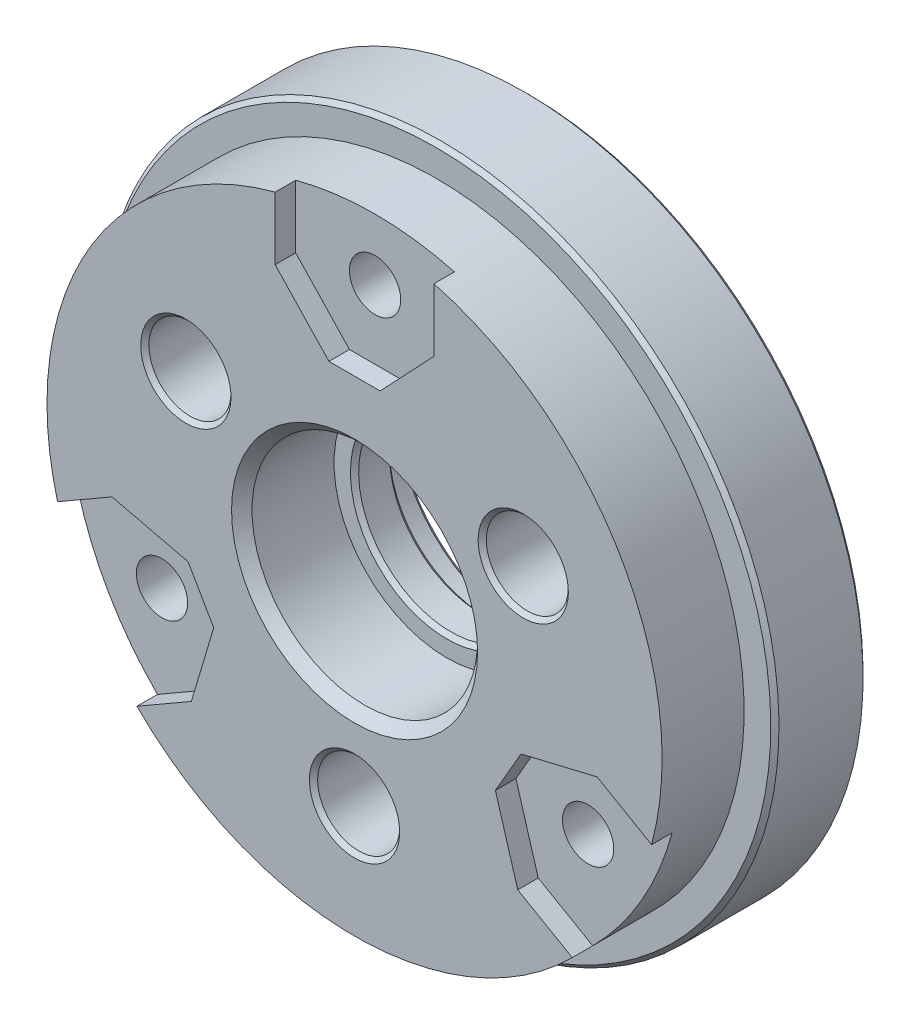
ISO-10303-21;
HEADER;
FILE_DESCRIPTION(('STEP AP214'),'2;1');
FILE_NAME('part.step','',(''),(''),'','','');
FILE_SCHEMA(('AUTOMOTIVE_DESIGN { 1 0 10303 214 1 1 1 1 }'));
ENDSEC;
DATA;
#1=APPLICATION_CONTEXT('core data for automotive mechanical design processes');
#2=APPLICATION_PROTOCOL_DEFINITION('international standard','automotive_design',2000,#1);
#3=PRODUCT_CONTEXT('',#1,'mechanical');
#4=PRODUCT('Part','Part','',(#3));
#5=PRODUCT_RELATED_PRODUCT_CATEGORY('part','',(#4));
#6=PRODUCT_DEFINITION_FORMATION('','',#4);
#7=PRODUCT_DEFINITION_CONTEXT('part definition',#1,'design');
#8=PRODUCT_DEFINITION('design','',#6,#7);
#9=PRODUCT_DEFINITION_SHAPE('','',#8);
#10=(LENGTH_UNIT() NAMED_UNIT(*) SI_UNIT(.MILLI.,.METRE.));
#11=(NAMED_UNIT(*) PLANE_ANGLE_UNIT() SI_UNIT($,.RADIAN.));
#12=(NAMED_UNIT(*) SI_UNIT($,.STERADIAN.) SOLID_ANGLE_UNIT());
#13=UNCERTAINTY_MEASURE_WITH_UNIT(LENGTH_MEASURE(1.E-05),#10,'distance_accuracy_value','');
#14=(GEOMETRIC_REPRESENTATION_CONTEXT(3) GLOBAL_UNCERTAINTY_ASSIGNED_CONTEXT((#13)) GLOBAL_UNIT_ASSIGNED_CONTEXT((#10,
#11,#12)) REPRESENTATION_CONTEXT('',''));
#15=CARTESIAN_POINT('',(0.,0.,0.));
#16=DIRECTION('',(0.,0.,1.));
#17=DIRECTION('',(1.,0.,0.));
#18=AXIS2_PLACEMENT_3D('',#15,#16,#17);
#19=CARTESIAN_POINT('',(0.,0.,-1.1));
#20=DIRECTION('',(0.,0.,-1.));
#21=DIRECTION('',(0.,-1.,0.));
#22=AXIS2_PLACEMENT_3D('',#19,#20,#21);
#23=PLANE('',#22);
#24=CARTESIAN_POINT('',(0.,-12.,-1.1));
#25=DIRECTION('',(0.,0.,1.));
#26=DIRECTION('',(1.,0.,0.));
#27=AXIS2_PLACEMENT_3D('',#24,#25,#26);
#28=CIRCLE('',#27,2.);
#29=CARTESIAN_POINT('',(2.,-12.,-1.1));
#30=VERTEX_POINT('',#29);
#31=EDGE_CURVE('E21',#30,#30,#28,.T.);
#32=ORIENTED_EDGE('',*,*,#31,.F.);
#33=EDGE_LOOP('',(#32));
#34=FACE_BOUND('',#33,.T.);
#35=ADVANCED_FACE('F17',(#34),#23,.T.);
#36=CARTESIAN_POINT('',(0.,-12.,-4.1));
#37=DIRECTION('',(0.,0.,-1.));
#38=DIRECTION('',(-1.,0.,0.));
#39=AXIS2_PLACEMENT_3D('',#36,#37,#38);
#40=CYLINDRICAL_SURFACE('',#39,2.);
#41=ORIENTED_EDGE('',*,*,#31,.T.);
#42=DIRECTION('',(0.,0.,-1.));
#43=VECTOR('',#42,1.);
#44=CARTESIAN_POINT('',(2.,-12.,-4.1));
#45=LINE('',#44,#43);
#46=CARTESIAN_POINT('',(2.,-12.,-3.9));
#47=VERTEX_POINT('',#46);
#48=EDGE_CURVE('E11',#30,#47,#45,.T.);
#49=ORIENTED_EDGE('',*,*,#48,.T.);
#50=CARTESIAN_POINT('',(0.,-12.,-3.9));
#51=DIRECTION('',(0.,0.,-1.));
#52=DIRECTION('',(0.,1.,0.));
#53=AXIS2_PLACEMENT_3D('',#50,#51,#52);
#54=CIRCLE('',#53,2.);
#55=CARTESIAN_POINT('',(0.,-10.,-3.9));
#56=VERTEX_POINT('',#55);
#57=EDGE_CURVE('E399',#47,#56,#54,.T.);
#58=ORIENTED_EDGE('',*,*,#57,.T.);
#59=CARTESIAN_POINT('',(0.,-12.,-3.9));
#60=DIRECTION('',(0.,0.,-1.));
#61=DIRECTION('',(0.,1.,0.));
#62=AXIS2_PLACEMENT_3D('',#59,#60,#61);
#63=CIRCLE('',#62,2.);
#64=EDGE_CURVE('E407',#56,#47,#63,.T.);
#65=ORIENTED_EDGE('',*,*,#64,.T.);
#66=ORIENTED_EDGE('',*,*,#48,.F.);
#67=EDGE_LOOP('',(#41,#49,#58,#65,#66));
#68=FACE_BOUND('',#67,.T.);
#69=ADVANCED_FACE('F19',(#68),#40,.F.);
#70=CARTESIAN_POINT('',(0.,-12.,-4.));
#71=DIRECTION('',(0.,0.,-1.));
#72=DIRECTION('',(0.,-1.,0.));
#73=AXIS2_PLACEMENT_3D('',#70,#71,#72);
#74=CONICAL_SURFACE('',#73,2.1,0.785398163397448);
#75=ORIENTED_EDGE('',*,*,#57,.F.);
#76=ORIENTED_EDGE('',*,*,#64,.F.);
#77=DIRECTION('',(0.,0.707106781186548,-0.707106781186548));
#78=VECTOR('',#77,1.);
#79=CARTESIAN_POINT('',(0.,-9.9,-4.));
#80=LINE('',#79,#78);
#81=CARTESIAN_POINT('',(0.,-9.8,-4.1));
#82=VERTEX_POINT('',#81);
#83=EDGE_CURVE('E49',#56,#82,#80,.T.);
#84=ORIENTED_EDGE('',*,*,#83,.T.);
#85=CARTESIAN_POINT('',(0.,-12.,-4.1));
#86=DIRECTION('',(0.,0.,-1.));
#87=DIRECTION('',(1.,0.,0.));
#88=AXIS2_PLACEMENT_3D('',#85,#86,#87);
#89=CIRCLE('',#88,2.2);
#90=EDGE_CURVE('E1201',#82,#82,#89,.T.);
#91=ORIENTED_EDGE('',*,*,#90,.T.);
#92=ORIENTED_EDGE('',*,*,#83,.F.);
#93=EDGE_LOOP('',(#75,#76,#84,#91,#92));
#94=FACE_BOUND('',#93,.T.);
#95=ADVANCED_FACE('F429',(#94),#74,.F.);
#96=CARTESIAN_POINT('',(0.,0.,-1.1));
#97=DIRECTION('',(0.,0.,-1.));
#98=DIRECTION('',(0.,-1.,0.));
#99=AXIS2_PLACEMENT_3D('',#96,#97,#98);
#100=PLANE('',#99);
#101=CARTESIAN_POINT('',(-10.39230484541,6.,-1.1));
#102=DIRECTION('',(0.,0.,1.));
#103=DIRECTION('',(-1.,0.,0.));
#104=AXIS2_PLACEMENT_3D('',#101,#102,#103);
#105=CIRCLE('',#104,2.);
#106=CARTESIAN_POINT('',(-8.392304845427,6.000000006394,-1.1));
#107=VERTEX_POINT('',#106);
#108=EDGE_CURVE('E393',#107,#107,#105,.T.);
#109=ORIENTED_EDGE('',*,*,#108,.F.);
#110=EDGE_LOOP('',(#109));
#111=FACE_BOUND('',#110,.T.);
#112=ADVANCED_FACE('F561',(#111),#100,.T.);
#113=CARTESIAN_POINT('',(-10.39230484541,6.,-4.1));
#114=DIRECTION('',(0.,0.,-1.));
#115=DIRECTION('',(-1.,0.,0.));
#116=AXIS2_PLACEMENT_3D('',#113,#114,#115);
#117=CYLINDRICAL_SURFACE('',#116,2.);
#118=ORIENTED_EDGE('',*,*,#108,.T.);
#119=DIRECTION('',(0.,0.,-1.));
#120=VECTOR('',#119,1.);
#121=CARTESIAN_POINT('',(-8.39230484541,6.,-4.1));
#122=LINE('',#121,#120);
#123=CARTESIAN_POINT('',(-8.39230484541,6.,-3.9));
#124=VERTEX_POINT('',#123);
#125=EDGE_CURVE('E390',#107,#124,#122,.T.);
#126=ORIENTED_EDGE('',*,*,#125,.T.);
#127=CARTESIAN_POINT('',(-10.39230484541,6.,-3.9));
#128=DIRECTION('',(0.,0.,-1.));
#129=DIRECTION('',(0.,-1.,0.));
#130=AXIS2_PLACEMENT_3D('',#127,#128,#129);
#131=CIRCLE('',#130,2.);
#132=CARTESIAN_POINT('',(-10.39230484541,8.,-3.9));
#133=VERTEX_POINT('',#132);
#134=EDGE_CURVE('E409',#124,#133,#131,.T.);
#135=ORIENTED_EDGE('',*,*,#134,.T.);
#136=CARTESIAN_POINT('',(-10.39230484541,6.,-3.9));
#137=DIRECTION('',(0.,0.,-1.));
#138=DIRECTION('',(0.,-1.,0.));
#139=AXIS2_PLACEMENT_3D('',#136,#137,#138);
#140=CIRCLE('',#139,2.);
#141=EDGE_CURVE('E396',#133,#124,#140,.T.);
#142=ORIENTED_EDGE('',*,*,#141,.T.);
#143=ORIENTED_EDGE('',*,*,#125,.F.);
#144=EDGE_LOOP('',(#118,#126,#135,#142,#143));
#145=FACE_BOUND('',#144,.T.);
#146=ADVANCED_FACE('F391',(#145),#117,.F.);
#147=CARTESIAN_POINT('',(-10.39230484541,6.,-4.));
#148=DIRECTION('',(0.,0.,-1.));
#149=DIRECTION('',(0.,-1.,0.));
#150=AXIS2_PLACEMENT_3D('',#147,#148,#149);
#151=CONICAL_SURFACE('',#150,2.1,0.785398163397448);
#152=ORIENTED_EDGE('',*,*,#141,.F.);
#153=DIRECTION('',(0.,0.707106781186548,-0.707106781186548));
#154=VECTOR('',#153,1.);
#155=CARTESIAN_POINT('',(-10.39230484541,8.1,-4.));
#156=LINE('',#155,#154);
#157=CARTESIAN_POINT('',(-10.39230484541,8.2,-4.1));
#158=VERTEX_POINT('',#157);
#159=EDGE_CURVE('E1904',#133,#158,#156,.T.);
#160=ORIENTED_EDGE('',*,*,#159,.T.);
#161=CARTESIAN_POINT('',(-10.39230484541,6.,-4.1));
#162=DIRECTION('',(0.,0.,-1.));
#163=DIRECTION('',(-1.,0.,0.));
#164=AXIS2_PLACEMENT_3D('',#161,#162,#163);
#165=CIRCLE('',#164,2.2);
#166=EDGE_CURVE('E1227',#158,#158,#165,.T.);
#167=ORIENTED_EDGE('',*,*,#166,.T.);
#168=ORIENTED_EDGE('',*,*,#159,.F.);
#169=ORIENTED_EDGE('',*,*,#134,.F.);
#170=EDGE_LOOP('',(#152,#160,#167,#168,#169));
#171=FACE_BOUND('',#170,.T.);
#172=ADVANCED_FACE('F560',(#171),#151,.F.);
#173=CARTESIAN_POINT('',(0.,0.,-1.1));
#174=DIRECTION('',(0.,0.,-1.));
#175=DIRECTION('',(0.,-1.,0.));
#176=AXIS2_PLACEMENT_3D('',#173,#174,#175);
#177=PLANE('',#176);
#178=CARTESIAN_POINT('',(10.39230484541,6.,-1.1));
#179=DIRECTION('',(0.,0.,1.));
#180=DIRECTION('',(1.,0.,0.));
#181=AXIS2_PLACEMENT_3D('',#178,#179,#180);
#182=CIRCLE('',#181,2.);
#183=CARTESIAN_POINT('',(12.39230484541,6.,-1.1));
#184=VERTEX_POINT('',#183);
#185=EDGE_CURVE('E1861',#184,#184,#182,.T.);
#186=ORIENTED_EDGE('',*,*,#185,.F.);
#187=EDGE_LOOP('',(#186));
#188=FACE_BOUND('',#187,.T.);
#189=ADVANCED_FACE('F548',(#188),#177,.T.);
#190=CARTESIAN_POINT('',(10.39230484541,6.,-4.1));
#191=DIRECTION('',(0.,0.,-1.));
#192=DIRECTION('',(-1.,0.,0.));
#193=AXIS2_PLACEMENT_3D('',#190,#191,#192);
#194=CYLINDRICAL_SURFACE('',#193,2.);
#195=ORIENTED_EDGE('',*,*,#185,.T.);
#196=DIRECTION('',(0.,0.,-1.));
#197=VECTOR('',#196,1.);
#198=CARTESIAN_POINT('',(12.39230484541,6.,-4.1));
#199=LINE('',#198,#197);
#200=CARTESIAN_POINT('',(12.39230484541,6.,-3.9));
#201=VERTEX_POINT('',#200);
#202=EDGE_CURVE('E1973',#184,#201,#199,.T.);
#203=ORIENTED_EDGE('',*,*,#202,.T.);
#204=CARTESIAN_POINT('',(10.39230484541,6.,-3.9));
#205=DIRECTION('',(0.,0.,-1.));
#206=DIRECTION('',(0.,1.,0.));
#207=AXIS2_PLACEMENT_3D('',#204,#205,#206);
#208=CIRCLE('',#207,2.);
#209=CARTESIAN_POINT('',(10.39230484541,8.,-3.9));
#210=VERTEX_POINT('',#209);
#211=EDGE_CURVE('E1956',#201,#210,#208,.T.);
#212=ORIENTED_EDGE('',*,*,#211,.T.);
#213=CARTESIAN_POINT('',(10.39230484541,6.,-3.9));
#214=DIRECTION('',(0.,0.,-1.));
#215=DIRECTION('',(0.,1.,0.));
#216=AXIS2_PLACEMENT_3D('',#213,#214,#215);
#217=CIRCLE('',#216,2.);
#218=EDGE_CURVE('E1862',#210,#201,#217,.T.);
#219=ORIENTED_EDGE('',*,*,#218,.T.);
#220=ORIENTED_EDGE('',*,*,#202,.F.);
#221=EDGE_LOOP('',(#195,#203,#212,#219,#220));
#222=FACE_BOUND('',#221,.T.);
#223=ADVANCED_FACE('F545',(#222),#194,.F.);
#224=CARTESIAN_POINT('',(10.39230484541,6.,-4.));
#225=DIRECTION('',(0.,0.,-1.));
#226=DIRECTION('',(0.,-1.,0.));
#227=AXIS2_PLACEMENT_3D('',#224,#225,#226);
#228=CONICAL_SURFACE('',#227,2.1,0.785398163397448);
#229=ORIENTED_EDGE('',*,*,#211,.F.);
#230=ORIENTED_EDGE('',*,*,#218,.F.);
#231=DIRECTION('',(0.,0.707106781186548,-0.707106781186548));
#232=VECTOR('',#231,1.);
#233=CARTESIAN_POINT('',(10.39230484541,8.1,-4.));
#234=LINE('',#233,#232);
#235=CARTESIAN_POINT('',(10.39230484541,8.2,-4.1));
#236=VERTEX_POINT('',#235);
#237=EDGE_CURVE('E1857',#210,#236,#234,.T.);
#238=ORIENTED_EDGE('',*,*,#237,.T.);
#239=CARTESIAN_POINT('',(10.39230484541,6.,-4.1));
#240=DIRECTION('',(0.,0.,-1.));
#241=DIRECTION('',(1.,0.,0.));
#242=AXIS2_PLACEMENT_3D('',#239,#240,#241);
#243=CIRCLE('',#242,2.2);
#244=EDGE_CURVE('E1232',#236,#236,#243,.T.);
#245=ORIENTED_EDGE('',*,*,#244,.T.);
#246=ORIENTED_EDGE('',*,*,#237,.F.);
#247=EDGE_LOOP('',(#229,#230,#238,#245,#246));
#248=FACE_BOUND('',#247,.T.);
#249=ADVANCED_FACE('F531',(#248),#228,.F.);
#250=CARTESIAN_POINT('',(6.,-10.39230484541,2.981050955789));
#251=DIRECTION('',(0.,0.,-1.));
#252=DIRECTION('',(1.,0.,0.));
#253=AXIS2_PLACEMENT_3D('',#250,#251,#252);
#254=CONICAL_SURFACE('',#253,0.8493967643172,1.02974425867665);
#255=DIRECTION('',(-0.857167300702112,0.,-0.515038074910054));
#256=VECTOR('',#255,1.);
#257=CARTESIAN_POINT('',(5.1506032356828,-10.39230484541,2.981050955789));
#258=LINE('',#257,#256);
#259=CARTESIAN_POINT('',(6.,-10.39230484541,3.491420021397));
#260=VERTEX_POINT('',#259);
#261=CARTESIAN_POINT('',(4.35,-10.39230484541,2.500000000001));
#262=VERTEX_POINT('',#261);
#263=EDGE_CURVE('E1950',#260,#262,#258,.T.);
#264=ORIENTED_EDGE('',*,*,#263,.T.);
#265=CARTESIAN_POINT('',(6.,-10.39230484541,2.500000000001));
#266=DIRECTION('',(0.,0.,1.));
#267=DIRECTION('',(1.,0.,0.));
#268=AXIS2_PLACEMENT_3D('',#265,#266,#267);
#269=CIRCLE('',#268,1.65);
#270=EDGE_CURVE('E1162',#262,#262,#269,.T.);
#271=ORIENTED_EDGE('',*,*,#270,.F.);
#272=ORIENTED_EDGE('',*,*,#263,.F.);
#273=EDGE_LOOP('',(#264,#271,#272));
#274=FACE_BOUND('',#273,.T.);
#275=ADVANCED_FACE('F527',(#274),#254,.F.);
#276=CARTESIAN_POINT('',(6.,-10.39230484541,-2.5));
#277=DIRECTION('',(0.,0.,-1.));
#278=DIRECTION('',(1.,0.,0.));
#279=AXIS2_PLACEMENT_3D('',#276,#277,#278);
#280=CYLINDRICAL_SURFACE('',#279,1.65);
#281=ORIENTED_EDGE('',*,*,#270,.T.);
#282=DIRECTION('',(0.,0.,-1.));
#283=VECTOR('',#282,1.);
#284=CARTESIAN_POINT('',(4.35,-10.39230484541,-2.5));
#285=LINE('',#284,#283);
#286=CARTESIAN_POINT('',(4.35,-10.39230484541,-4.1));
#287=VERTEX_POINT('',#286);
#288=EDGE_CURVE('E1568',#262,#287,#285,.T.);
#289=ORIENTED_EDGE('',*,*,#288,.T.);
#290=CARTESIAN_POINT('',(6.,-10.39230484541,-4.1));
#291=DIRECTION('',(0.,0.,-1.));
#292=DIRECTION('',(1.,0.,0.));
#293=AXIS2_PLACEMENT_3D('',#290,#291,#292);
#294=CIRCLE('',#293,1.65);
#295=EDGE_CURVE('E1329',#287,#287,#294,.T.);
#296=ORIENTED_EDGE('',*,*,#295,.T.);
#297=ORIENTED_EDGE('',*,*,#288,.F.);
#298=EDGE_LOOP('',(#281,#289,#296,#297));
#299=FACE_BOUND('',#298,.T.);
#300=ADVANCED_FACE('F530',(#299),#280,.F.);
#301=CARTESIAN_POINT('',(12.,0.,2.981050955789));
#302=DIRECTION('',(0.,0.,-1.));
#303=DIRECTION('',(1.,0.,0.));
#304=AXIS2_PLACEMENT_3D('',#301,#302,#303);
#305=CONICAL_SURFACE('',#304,0.8493967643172,1.02974425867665);
#306=DIRECTION('',(-0.857167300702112,0.,-0.515038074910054));
#307=VECTOR('',#306,1.);
#308=CARTESIAN_POINT('',(11.1506032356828,0.,2.981050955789));
#309=LINE('',#308,#307);
#310=CARTESIAN_POINT('',(12.,0.,3.491420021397));
#311=VERTEX_POINT('',#310);
#312=CARTESIAN_POINT('',(10.35,0.,2.50000000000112));
#313=VERTEX_POINT('',#312);
#314=EDGE_CURVE('E1158',#311,#313,#309,.T.);
#315=ORIENTED_EDGE('',*,*,#314,.T.);
#316=CARTESIAN_POINT('',(12.,0.,2.500000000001));
#317=DIRECTION('',(0.,0.,1.));
#318=DIRECTION('',(-0.499999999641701,-0.866025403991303,0.));
#319=AXIS2_PLACEMENT_3D('',#316,#317,#318);
#320=CIRCLE('',#319,1.65);
#321=CARTESIAN_POINT('',(11.175,-1.42894191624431,2.500000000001));
#322=VERTEX_POINT('',#321);
#323=EDGE_CURVE('E1928',#322,#313,#320,.T.);
#324=ORIENTED_EDGE('',*,*,#323,.F.);
#325=CARTESIAN_POINT('',(12.,0.,2.500000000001));
#326=DIRECTION('',(0.,0.,1.));
#327=DIRECTION('',(-0.499999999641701,-0.866025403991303,0.));
#328=AXIS2_PLACEMENT_3D('',#325,#326,#327);
#329=CIRCLE('',#328,1.65);
#330=EDGE_CURVE('E1935',#313,#322,#329,.T.);
#331=ORIENTED_EDGE('',*,*,#330,.F.);
#332=ORIENTED_EDGE('',*,*,#314,.F.);
#333=EDGE_LOOP('',(#315,#324,#331,#332));
#334=FACE_BOUND('',#333,.T.);
#335=ADVANCED_FACE('F587',(#334),#305,.F.);
#336=CARTESIAN_POINT('',(12.,0.,-2.5));
#337=DIRECTION('',(0.,0.,-1.));
#338=DIRECTION('',(0.500000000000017,0.866025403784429,0.));
#339=AXIS2_PLACEMENT_3D('',#336,#337,#338);
#340=CYLINDRICAL_SURFACE('',#339,1.65);
#341=ORIENTED_EDGE('',*,*,#323,.T.);
#342=ORIENTED_EDGE('',*,*,#330,.T.);
#343=DIRECTION('',(0.,0.,-1.));
#344=VECTOR('',#343,1.);
#345=CARTESIAN_POINT('',(11.175,-1.42894191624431,-2.5));
#346=LINE('',#345,#344);
#347=CARTESIAN_POINT('',(11.175,-1.428941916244,-4.1));
#348=VERTEX_POINT('',#347);
#349=EDGE_CURVE('E1163',#322,#348,#346,.T.);
#350=ORIENTED_EDGE('',*,*,#349,.T.);
#351=CARTESIAN_POINT('',(12.,0.,-4.1));
#352=DIRECTION('',(0.,0.,-1.));
#353=DIRECTION('',(0.500000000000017,0.866025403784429,0.));
#354=AXIS2_PLACEMENT_3D('',#351,#352,#353);
#355=CIRCLE('',#354,1.65);
#356=EDGE_CURVE('E1322',#348,#348,#355,.T.);
#357=ORIENTED_EDGE('',*,*,#356,.T.);
#358=ORIENTED_EDGE('',*,*,#349,.F.);
#359=EDGE_LOOP('',(#341,#342,#350,#357,#358));
#360=FACE_BOUND('',#359,.T.);
#361=ADVANCED_FACE('F590',(#360),#340,.F.);
#362=CARTESIAN_POINT('',(6.,10.39230484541,2.981050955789));
#363=DIRECTION('',(0.,0.,-1.));
#364=DIRECTION('',(1.,0.,0.));
#365=AXIS2_PLACEMENT_3D('',#362,#363,#364);
#366=CONICAL_SURFACE('',#365,0.8493967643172,1.02974425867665);
#367=DIRECTION('',(-0.857167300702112,0.,-0.515038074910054));
#368=VECTOR('',#367,1.);
#369=CARTESIAN_POINT('',(5.1506032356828,10.39230484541,2.981050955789));
#370=LINE('',#369,#368);
#371=CARTESIAN_POINT('',(6.,10.39230484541,3.491420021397));
#372=VERTEX_POINT('',#371);
#373=CARTESIAN_POINT('',(4.34999999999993,10.39230484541,2.50000000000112));
#374=VERTEX_POINT('',#373);
#375=EDGE_CURVE('E1922',#372,#374,#370,.T.);
#376=ORIENTED_EDGE('',*,*,#375,.T.);
#377=CARTESIAN_POINT('',(6.,10.39230484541,2.500000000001));
#378=DIRECTION('',(0.,0.,1.));
#379=DIRECTION('',(0.499999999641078,-0.866025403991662,0.));
#380=AXIS2_PLACEMENT_3D('',#377,#378,#379);
#381=CIRCLE('',#380,1.65);
#382=CARTESIAN_POINT('',(6.825,8.96336292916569,2.500000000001));
#383=VERTEX_POINT('',#382);
#384=EDGE_CURVE('E1893',#383,#374,#381,.T.);
#385=ORIENTED_EDGE('',*,*,#384,.F.);
#386=CARTESIAN_POINT('',(6.,10.39230484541,2.500000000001));
#387=DIRECTION('',(0.,0.,1.));
#388=DIRECTION('',(0.499999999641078,-0.866025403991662,0.));
#389=AXIS2_PLACEMENT_3D('',#386,#387,#388);
#390=CIRCLE('',#389,1.65);
#391=EDGE_CURVE('E1900',#374,#383,#390,.T.);
#392=ORIENTED_EDGE('',*,*,#391,.F.);
#393=ORIENTED_EDGE('',*,*,#375,.F.);
#394=EDGE_LOOP('',(#376,#385,#392,#393));
#395=FACE_BOUND('',#394,.T.);
#396=ADVANCED_FACE('F644',(#395),#366,.F.);
#397=CARTESIAN_POINT('',(6.,10.39230484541,-2.5));
#398=DIRECTION('',(0.,0.,-1.));
#399=DIRECTION('',(-0.500000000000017,0.866025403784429,0.));
#400=AXIS2_PLACEMENT_3D('',#397,#398,#399);
#401=CYLINDRICAL_SURFACE('',#400,1.65);
#402=ORIENTED_EDGE('',*,*,#384,.T.);
#403=ORIENTED_EDGE('',*,*,#391,.T.);
#404=DIRECTION('',(0.,0.,-1.));
#405=VECTOR('',#404,1.);
#406=CARTESIAN_POINT('',(6.825,8.96336292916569,-2.5));
#407=LINE('',#406,#405);
#408=CARTESIAN_POINT('',(6.825,8.963362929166,-4.1));
#409=VERTEX_POINT('',#408);
#410=EDGE_CURVE('E1915',#383,#409,#407,.T.);
#411=ORIENTED_EDGE('',*,*,#410,.T.);
#412=CARTESIAN_POINT('',(6.,10.39230484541,-4.1));
#413=DIRECTION('',(0.,0.,-1.));
#414=DIRECTION('',(-0.500000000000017,0.866025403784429,0.));
#415=AXIS2_PLACEMENT_3D('',#412,#413,#414);
#416=CIRCLE('',#415,1.65);
#417=EDGE_CURVE('E1315',#409,#409,#416,.T.);
#418=ORIENTED_EDGE('',*,*,#417,.T.);
#419=ORIENTED_EDGE('',*,*,#410,.F.);
#420=EDGE_LOOP('',(#402,#403,#411,#418,#419));
#421=FACE_BOUND('',#420,.T.);
#422=ADVANCED_FACE('F640',(#421),#401,.F.);
#423=CARTESIAN_POINT('',(-6.,10.39230484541,2.981050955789));
#424=DIRECTION('',(0.,0.,-1.));
#425=DIRECTION('',(1.,0.,0.));
#426=AXIS2_PLACEMENT_3D('',#423,#424,#425);
#427=CONICAL_SURFACE('',#426,0.8493967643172,1.02974425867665);
#428=DIRECTION('',(-0.857167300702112,0.,-0.515038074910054));
#429=VECTOR('',#428,1.);
#430=CARTESIAN_POINT('',(-6.8493967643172,10.39230484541,2.981050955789));
#431=LINE('',#430,#429);
#432=CARTESIAN_POINT('',(-6.,10.39230484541,3.491420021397));
#433=VERTEX_POINT('',#432);
#434=CARTESIAN_POINT('',(-7.65,10.39230484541,2.50000000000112));
#435=VERTEX_POINT('',#434);
#436=EDGE_CURVE('E1887',#433,#435,#431,.T.);
#437=ORIENTED_EDGE('',*,*,#436,.T.);
#438=CARTESIAN_POINT('',(-6.,10.39230484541,2.500000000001));
#439=DIRECTION('',(0.,0.,1.));
#440=DIRECTION('',(-1.,0.,0.));
#441=AXIS2_PLACEMENT_3D('',#438,#439,#440);
#442=CIRCLE('',#441,1.65);
#443=CARTESIAN_POINT('',(-4.35,10.39230484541,2.500000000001));
#444=VERTEX_POINT('',#443);
#445=EDGE_CURVE('E1853',#444,#435,#442,.T.);
#446=ORIENTED_EDGE('',*,*,#445,.F.);
#447=CARTESIAN_POINT('',(-6.,10.39230484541,2.500000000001));
#448=DIRECTION('',(0.,0.,1.));
#449=DIRECTION('',(-1.,0.,0.));
#450=AXIS2_PLACEMENT_3D('',#447,#448,#449);
#451=CIRCLE('',#450,1.65);
#452=EDGE_CURVE('E1870',#435,#444,#451,.T.);
#453=ORIENTED_EDGE('',*,*,#452,.F.);
#454=ORIENTED_EDGE('',*,*,#436,.F.);
#455=EDGE_LOOP('',(#437,#446,#453,#454));
#456=FACE_BOUND('',#455,.T.);
#457=ADVANCED_FACE('F633',(#456),#427,.F.);
#458=CARTESIAN_POINT('',(-6.,10.39230484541,-2.5));
#459=DIRECTION('',(0.,0.,-1.));
#460=DIRECTION('',(-1.,0.,0.));
#461=AXIS2_PLACEMENT_3D('',#458,#459,#460);
#462=CYLINDRICAL_SURFACE('',#461,1.65);
#463=ORIENTED_EDGE('',*,*,#445,.T.);
#464=ORIENTED_EDGE('',*,*,#452,.T.);
#465=DIRECTION('',(0.,0.,-1.));
#466=VECTOR('',#465,1.);
#467=CARTESIAN_POINT('',(-4.35,10.39230484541,-2.5));
#468=LINE('',#467,#466);
#469=CARTESIAN_POINT('',(-4.35,10.39230484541,-4.1));
#470=VERTEX_POINT('',#469);
#471=EDGE_CURVE('E1880',#444,#470,#468,.T.);
#472=ORIENTED_EDGE('',*,*,#471,.T.);
#473=CARTESIAN_POINT('',(-6.,10.39230484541,-4.1));
#474=DIRECTION('',(0.,0.,-1.));
#475=DIRECTION('',(-1.,0.,0.));
#476=AXIS2_PLACEMENT_3D('',#473,#474,#475);
#477=CIRCLE('',#476,1.65);
#478=EDGE_CURVE('E1308',#470,#470,#477,.T.);
#479=ORIENTED_EDGE('',*,*,#478,.T.);
#480=ORIENTED_EDGE('',*,*,#471,.F.);
#481=EDGE_LOOP('',(#463,#464,#472,#479,#480));
#482=FACE_BOUND('',#481,.T.);
#483=ADVANCED_FACE('F620',(#482),#462,.F.);
#484=CARTESIAN_POINT('',(-12.,0.,2.981050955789));
#485=DIRECTION('',(0.,0.,-1.));
#486=DIRECTION('',(1.,0.,0.));
#487=AXIS2_PLACEMENT_3D('',#484,#485,#486);
#488=CONICAL_SURFACE('',#487,0.8493967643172,1.02974425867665);
#489=DIRECTION('',(-0.857167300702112,0.,-0.515038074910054));
#490=VECTOR('',#489,1.);
#491=CARTESIAN_POINT('',(-12.8493967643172,0.,2.981050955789));
#492=LINE('',#491,#490);
#493=CARTESIAN_POINT('',(-12.,0.,3.491420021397));
#494=VERTEX_POINT('',#493);
#495=CARTESIAN_POINT('',(-13.65,0.,2.500000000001));
#496=VERTEX_POINT('',#495);
#497=EDGE_CURVE('E1535',#494,#496,#492,.T.);
#498=ORIENTED_EDGE('',*,*,#497,.T.);
#499=CARTESIAN_POINT('',(-12.,0.,2.500000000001));
#500=DIRECTION('',(0.,0.,1.));
#501=DIRECTION('',(0.499999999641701,0.866025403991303,0.));
#502=AXIS2_PLACEMENT_3D('',#499,#500,#501);
#503=CIRCLE('',#502,1.65);
#504=CARTESIAN_POINT('',(-11.175,1.42894191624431,2.500000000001));
#505=VERTEX_POINT('',#504);
#506=EDGE_CURVE('E1467',#505,#496,#503,.T.);
#507=ORIENTED_EDGE('',*,*,#506,.F.);
#508=CARTESIAN_POINT('',(-12.,0.,2.500000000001));
#509=DIRECTION('',(0.,0.,1.));
#510=DIRECTION('',(0.499999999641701,0.866025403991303,0.));
#511=AXIS2_PLACEMENT_3D('',#508,#509,#510);
#512=CIRCLE('',#511,1.65);
#513=EDGE_CURVE('E1452',#496,#505,#512,.T.);
#514=ORIENTED_EDGE('',*,*,#513,.F.);
#515=ORIENTED_EDGE('',*,*,#497,.F.);
#516=EDGE_LOOP('',(#498,#507,#514,#515));
#517=FACE_BOUND('',#516,.T.);
#518=ADVANCED_FACE('F616',(#517),#488,.F.);
#519=CARTESIAN_POINT('',(-12.,0.,-2.5));
#520=DIRECTION('',(0.,0.,-1.));
#521=DIRECTION('',(-0.500000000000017,-0.866025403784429,0.));
#522=AXIS2_PLACEMENT_3D('',#519,#520,#521);
#523=CYLINDRICAL_SURFACE('',#522,1.65);
#524=ORIENTED_EDGE('',*,*,#513,.T.);
#525=DIRECTION('',(0.,0.,-1.));
#526=VECTOR('',#525,1.);
#527=CARTESIAN_POINT('',(-11.175,1.42894191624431,-2.5));
#528=LINE('',#527,#526);
#529=CARTESIAN_POINT('',(-11.175,1.428941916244,-4.1));
#530=VERTEX_POINT('',#529);
#531=EDGE_CURVE('E1463',#505,#530,#528,.T.);
#532=ORIENTED_EDGE('',*,*,#531,.T.);
#533=CARTESIAN_POINT('',(-12.,0.,-4.1));
#534=DIRECTION('',(0.,0.,-1.));
#535=DIRECTION('',(-0.500000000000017,-0.866025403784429,0.));
#536=AXIS2_PLACEMENT_3D('',#533,#534,#535);
#537=CIRCLE('',#536,1.65);
#538=EDGE_CURVE('E1269',#530,#530,#537,.T.);
#539=ORIENTED_EDGE('',*,*,#538,.T.);
#540=ORIENTED_EDGE('',*,*,#531,.F.);
#541=ORIENTED_EDGE('',*,*,#506,.T.);
#542=EDGE_LOOP('',(#524,#532,#539,#540,#541));
#543=FACE_BOUND('',#542,.T.);
#544=ADVANCED_FACE('F619',(#543),#523,.F.);
#545=CARTESIAN_POINT('',(-6.,-10.39230484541,2.981050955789));
#546=DIRECTION('',(0.,0.,-1.));
#547=DIRECTION('',(1.,0.,0.));
#548=AXIS2_PLACEMENT_3D('',#545,#546,#547);
#549=CONICAL_SURFACE('',#548,0.8493967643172,1.02974425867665);
#550=DIRECTION('',(-0.857167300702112,0.,-0.515038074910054));
#551=VECTOR('',#550,1.);
#552=CARTESIAN_POINT('',(-6.8493967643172,-10.39230484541,2.981050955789));
#553=LINE('',#552,#551);
#554=CARTESIAN_POINT('',(-6.,-10.39230484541,3.491420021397));
#555=VERTEX_POINT('',#554);
#556=CARTESIAN_POINT('',(-7.65,-10.39230484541,2.500000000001));
#557=VERTEX_POINT('',#556);
#558=EDGE_CURVE('E1448',#555,#557,#553,.T.);
#559=ORIENTED_EDGE('',*,*,#558,.T.);
#560=CARTESIAN_POINT('',(-6.,-10.39230484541,2.500000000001));
#561=DIRECTION('',(0.,0.,1.));
#562=DIRECTION('',(-0.499999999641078,0.866025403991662,0.));
#563=AXIS2_PLACEMENT_3D('',#560,#561,#562);
#564=CIRCLE('',#563,1.65);
#565=CARTESIAN_POINT('',(-6.825,-8.96336292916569,2.500000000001));
#566=VERTEX_POINT('',#565);
#567=EDGE_CURVE('E1453',#566,#557,#564,.T.);
#568=ORIENTED_EDGE('',*,*,#567,.F.);
#569=CARTESIAN_POINT('',(-6.,-10.39230484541,2.500000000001));
#570=DIRECTION('',(0.,0.,1.));
#571=DIRECTION('',(-0.499999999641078,0.866025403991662,0.));
#572=AXIS2_PLACEMENT_3D('',#569,#570,#571);
#573=CIRCLE('',#572,1.65);
#574=EDGE_CURVE('E1663',#557,#566,#573,.T.);
#575=ORIENTED_EDGE('',*,*,#574,.F.);
#576=ORIENTED_EDGE('',*,*,#558,.F.);
#577=EDGE_LOOP('',(#559,#568,#575,#576));
#578=FACE_BOUND('',#577,.T.);
#579=ADVANCED_FACE('F499',(#578),#549,.F.);
#580=CARTESIAN_POINT('',(-6.,-10.39230484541,-2.5));
#581=DIRECTION('',(0.,0.,-1.));
#582=DIRECTION('',(0.500000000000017,-0.866025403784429,0.));
#583=AXIS2_PLACEMENT_3D('',#580,#581,#582);
#584=CYLINDRICAL_SURFACE('',#583,1.65);
#585=ORIENTED_EDGE('',*,*,#574,.T.);
#586=DIRECTION('',(0.,0.,-1.));
#587=VECTOR('',#586,1.);
#588=CARTESIAN_POINT('',(-6.825,-8.96336292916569,-2.5));
#589=LINE('',#588,#587);
#590=CARTESIAN_POINT('',(-6.825,-8.963362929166,-4.1));
#591=VERTEX_POINT('',#590);
#592=EDGE_CURVE('E1659',#566,#591,#589,.T.);
#593=ORIENTED_EDGE('',*,*,#592,.T.);
#594=CARTESIAN_POINT('',(-6.,-10.39230484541,-4.1));
#595=DIRECTION('',(0.,0.,-1.));
#596=DIRECTION('',(0.500000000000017,-0.866025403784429,0.));
#597=AXIS2_PLACEMENT_3D('',#594,#595,#596);
#598=CIRCLE('',#597,1.65);
#599=EDGE_CURVE('E1262',#591,#591,#598,.T.);
#600=ORIENTED_EDGE('',*,*,#599,.T.);
#601=ORIENTED_EDGE('',*,*,#592,.F.);
#602=ORIENTED_EDGE('',*,*,#567,.T.);
#603=EDGE_LOOP('',(#585,#593,#600,#601,#602));
#604=FACE_BOUND('',#603,.T.);
#605=ADVANCED_FACE('F496',(#604),#584,.F.);
#606=CARTESIAN_POINT('',(0.,0.,0.4));
#607=DIRECTION('',(0.,0.,1.));
#608=DIRECTION('',(1.,0.,0.));
#609=AXIS2_PLACEMENT_3D('',#606,#607,#608);
#610=PLANE('',#609);
#611=CARTESIAN_POINT('',(-8.227241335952,4.75,0.4));
#612=DIRECTION('',(0.,0.,-1.));
#613=DIRECTION('',(-3.385025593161E-10,-1.,0.));
#614=AXIS2_PLACEMENT_3D('',#611,#612,#613);
#615=CIRCLE('',#614,2.);
#616=CARTESIAN_POINT('',(-8.227241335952,2.75,0.4));
#617=VERTEX_POINT('',#616);
#618=EDGE_CURVE('E1655',#617,#617,#615,.T.);
#619=ORIENTED_EDGE('',*,*,#618,.F.);
#620=EDGE_LOOP('',(#619));
#621=FACE_BOUND('',#620,.T.);
#622=ADVANCED_FACE('F470',(#621),#610,.T.);
#623=CARTESIAN_POINT('',(-8.227241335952,4.75,4.));
#624=DIRECTION('',(0.,0.,1.));
#625=DIRECTION('',(0.,1.,0.));
#626=AXIS2_PLACEMENT_3D('',#623,#624,#625);
#627=CYLINDRICAL_SURFACE('',#626,2.);
#628=ORIENTED_EDGE('',*,*,#618,.T.);
#629=DIRECTION('',(0.,0.,1.));
#630=VECTOR('',#629,1.);
#631=CARTESIAN_POINT('',(-8.227241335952,2.75,4.));
#632=LINE('',#631,#630);
#633=CARTESIAN_POINT('',(-8.227241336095,2.75,4.2));
#634=VERTEX_POINT('',#633);
#635=EDGE_CURVE('E1828',#617,#634,#632,.T.);
#636=ORIENTED_EDGE('',*,*,#635,.T.);
#637=CARTESIAN_POINT('',(-8.227241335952,4.75,4.2));
#638=DIRECTION('',(0.,0.,1.));
#639=DIRECTION('',(-1.433626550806E-10,-1.,0.));
#640=AXIS2_PLACEMENT_3D('',#637,#638,#639);
#641=CIRCLE('',#640,2.);
#642=CARTESIAN_POINT('',(-8.227241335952,6.75,4.2));
#643=VERTEX_POINT('',#642);
#644=EDGE_CURVE('E1430',#634,#643,#641,.T.);
#645=ORIENTED_EDGE('',*,*,#644,.T.);
#646=CARTESIAN_POINT('',(-8.227241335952,4.75,4.2));
#647=DIRECTION('',(0.,0.,1.));
#648=DIRECTION('',(-1.433626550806E-10,-1.,0.));
#649=AXIS2_PLACEMENT_3D('',#646,#647,#648);
#650=CIRCLE('',#649,2.);
#651=EDGE_CURVE('E1435',#643,#634,#650,.T.);
#652=ORIENTED_EDGE('',*,*,#651,.T.);
#653=ORIENTED_EDGE('',*,*,#635,.F.);
#654=EDGE_LOOP('',(#628,#636,#645,#652,#653));
#655=FACE_BOUND('',#654,.T.);
#656=ADVANCED_FACE('F466',(#655),#627,.F.);
#657=CARTESIAN_POINT('',(-8.227241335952,4.75,4.3));
#658=DIRECTION('',(0.,0.,1.));
#659=DIRECTION('',(0.,-1.,0.));
#660=AXIS2_PLACEMENT_3D('',#657,#658,#659);
#661=CONICAL_SURFACE('',#660,2.1,0.785398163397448);
#662=ORIENTED_EDGE('',*,*,#644,.F.);
#663=ORIENTED_EDGE('',*,*,#651,.F.);
#664=DIRECTION('',(0.,0.707106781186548,0.707106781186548));
#665=VECTOR('',#664,1.);
#666=CARTESIAN_POINT('',(-8.227241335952,6.85,4.3));
#667=LINE('',#666,#665);
#668=CARTESIAN_POINT('',(-8.227241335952,6.95,4.4));
#669=VERTEX_POINT('',#668);
#670=EDGE_CURVE('E1651',#643,#669,#667,.T.);
#671=ORIENTED_EDGE('',*,*,#670,.T.);
#672=CARTESIAN_POINT('',(-8.227241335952,4.75,4.4));
#673=DIRECTION('',(0.,0.,1.));
#674=DIRECTION('',(-3.969083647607E-10,-1.,0.));
#675=AXIS2_PLACEMENT_3D('',#672,#673,#674);
#676=CIRCLE('',#675,2.2);
#677=EDGE_CURVE('E1394',#669,#669,#676,.T.);
#678=ORIENTED_EDGE('',*,*,#677,.T.);
#679=ORIENTED_EDGE('',*,*,#670,.F.);
#680=EDGE_LOOP('',(#662,#663,#671,#678,#679));
#681=FACE_BOUND('',#680,.T.);
#682=ADVANCED_FACE('F469',(#681),#661,.F.);
#683=CARTESIAN_POINT('',(0.,0.,0.4));
#684=DIRECTION('',(0.,0.,1.));
#685=DIRECTION('',(1.,0.,0.));
#686=AXIS2_PLACEMENT_3D('',#683,#684,#685);
#687=PLANE('',#686);
#688=CARTESIAN_POINT('',(8.227241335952,4.75,0.4));
#689=DIRECTION('',(0.,0.,-1.));
#690=DIRECTION('',(-3.384954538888E-10,-1.,0.));
#691=AXIS2_PLACEMENT_3D('',#688,#689,#690);
#692=CIRCLE('',#691,2.);
#693=CARTESIAN_POINT('',(8.227241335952,2.75,0.4));
#694=VERTEX_POINT('',#693);
#695=EDGE_CURVE('E1683',#694,#694,#692,.T.);
#696=ORIENTED_EDGE('',*,*,#695,.F.);
#697=EDGE_LOOP('',(#696));
#698=FACE_BOUND('',#697,.T.);
#699=ADVANCED_FACE('F608',(#698),#687,.T.);
#700=CARTESIAN_POINT('',(8.227241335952,4.75,4.));
#701=DIRECTION('',(0.,0.,1.));
#702=DIRECTION('',(0.,1.,0.));
#703=AXIS2_PLACEMENT_3D('',#700,#701,#702);
#704=CYLINDRICAL_SURFACE('',#703,2.);
#705=ORIENTED_EDGE('',*,*,#695,.T.);
#706=DIRECTION('',(0.,0.,1.));
#707=VECTOR('',#706,1.);
#708=CARTESIAN_POINT('',(8.227241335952,2.75,4.));
#709=LINE('',#708,#707);
#710=CARTESIAN_POINT('',(8.227241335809,2.75,4.2));
#711=VERTEX_POINT('',#710);
#712=EDGE_CURVE('E1436',#694,#711,#709,.T.);
#713=ORIENTED_EDGE('',*,*,#712,.T.);
#714=CARTESIAN_POINT('',(8.227241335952,4.75,4.2));
#715=DIRECTION('',(0.,0.,1.));
#716=DIRECTION('',(-1.43359102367E-10,-1.,0.));
#717=AXIS2_PLACEMENT_3D('',#714,#715,#716);
#718=CIRCLE('',#717,2.);
#719=CARTESIAN_POINT('',(8.227241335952,6.75,4.2));
#720=VERTEX_POINT('',#719);
#721=EDGE_CURVE('E1775',#711,#720,#718,.T.);
#722=ORIENTED_EDGE('',*,*,#721,.T.);
#723=CARTESIAN_POINT('',(8.227241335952,4.75,4.2));
#724=DIRECTION('',(0.,0.,1.));
#725=DIRECTION('',(-1.43359102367E-10,-1.,0.));
#726=AXIS2_PLACEMENT_3D('',#723,#724,#725);
#727=CIRCLE('',#726,2.);
#728=EDGE_CURVE('E1780',#720,#711,#727,.T.);
#729=ORIENTED_EDGE('',*,*,#728,.T.);
#730=ORIENTED_EDGE('',*,*,#712,.F.);
#731=EDGE_LOOP('',(#705,#713,#722,#729,#730));
#732=FACE_BOUND('',#731,.T.);
#733=ADVANCED_FACE('F572',(#732),#704,.F.);
#734=CARTESIAN_POINT('',(8.227241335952,4.75,4.3));
#735=DIRECTION('',(0.,0.,1.));
#736=DIRECTION('',(0.,-1.,0.));
#737=AXIS2_PLACEMENT_3D('',#734,#735,#736);
#738=CONICAL_SURFACE('',#737,2.1,0.785398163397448);
#739=ORIENTED_EDGE('',*,*,#721,.F.);
#740=ORIENTED_EDGE('',*,*,#728,.F.);
#741=DIRECTION('',(0.,0.707106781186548,0.707106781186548));
#742=VECTOR('',#741,1.);
#743=CARTESIAN_POINT('',(8.227241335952,6.85,4.3));
#744=LINE('',#743,#742);
#745=CARTESIAN_POINT('',(8.227241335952,6.95,4.4));
#746=VERTEX_POINT('',#745);
#747=EDGE_CURVE('E1803',#720,#746,#744,.T.);
#748=ORIENTED_EDGE('',*,*,#747,.T.);
#749=CARTESIAN_POINT('',(8.227241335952,4.75,4.4));
#750=DIRECTION('',(0.,0.,1.));
#751=DIRECTION('',(-3.971465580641E-10,-1.,0.));
#752=AXIS2_PLACEMENT_3D('',#749,#750,#751);
#753=CIRCLE('',#752,2.2);
#754=EDGE_CURVE('E1400',#746,#746,#753,.T.);
#755=ORIENTED_EDGE('',*,*,#754,.T.);
#756=ORIENTED_EDGE('',*,*,#747,.F.);
#757=EDGE_LOOP('',(#739,#740,#748,#755,#756));
#758=FACE_BOUND('',#757,.T.);
#759=ADVANCED_FACE('F568',(#758),#738,.F.);
#760=CARTESIAN_POINT('',(0.,0.,0.4));
#761=DIRECTION('',(0.,0.,1.));
#762=DIRECTION('',(1.,0.,0.));
#763=AXIS2_PLACEMENT_3D('',#760,#761,#762);
#764=PLANE('',#763);
#765=CARTESIAN_POINT('',(0.,-9.5,0.4));
#766=DIRECTION('',(0.,0.,-1.));
#767=DIRECTION('',(-3.38287050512E-10,-1.,0.));
#768=AXIS2_PLACEMENT_3D('',#765,#766,#767);
#769=CIRCLE('',#768,2.);
#770=CARTESIAN_POINT('',(0.,-11.5,0.4));
#771=VERTEX_POINT('',#770);
#772=EDGE_CURVE('E1789',#771,#771,#769,.T.);
#773=ORIENTED_EDGE('',*,*,#772,.F.);
#774=EDGE_LOOP('',(#773));
#775=FACE_BOUND('',#774,.T.);
#776=ADVANCED_FACE('F571',(#775),#764,.T.);
#777=CARTESIAN_POINT('',(0.,-9.5,4.));
#778=DIRECTION('',(0.,0.,1.));
#779=DIRECTION('',(0.,1.,0.));
#780=AXIS2_PLACEMENT_3D('',#777,#778,#779);
#781=CYLINDRICAL_SURFACE('',#780,2.);
#782=ORIENTED_EDGE('',*,*,#772,.T.);
#783=DIRECTION('',(0.,0.,1.));
#784=VECTOR('',#783,1.);
#785=CARTESIAN_POINT('',(0.,-11.5,4.));
#786=LINE('',#785,#784);
#787=CARTESIAN_POINT('',(-1.433122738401E-10,-11.5,4.2));
#788=VERTEX_POINT('',#787);
#789=EDGE_CURVE('E1781',#771,#788,#786,.T.);
#790=ORIENTED_EDGE('',*,*,#789,.T.);
#791=CARTESIAN_POINT('',(0.,-9.5,4.2));
#792=DIRECTION('',(0.,0.,1.));
#793=DIRECTION('',(-1.433121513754E-10,-1.,0.));
#794=AXIS2_PLACEMENT_3D('',#791,#792,#793);
#795=CIRCLE('',#794,2.);
#796=CARTESIAN_POINT('',(0.,-7.5,4.2));
#797=VERTEX_POINT('',#796);
#798=EDGE_CURVE('E1146',#788,#797,#795,.T.);
#799=ORIENTED_EDGE('',*,*,#798,.T.);
#800=CARTESIAN_POINT('',(0.,-9.5,4.2));
#801=DIRECTION('',(0.,0.,1.));
#802=DIRECTION('',(-1.433121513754E-10,-1.,0.));
#803=AXIS2_PLACEMENT_3D('',#800,#801,#802);
#804=CIRCLE('',#803,2.);
#805=EDGE_CURVE('E1140',#797,#788,#804,.T.);
#806=ORIENTED_EDGE('',*,*,#805,.T.);
#807=ORIENTED_EDGE('',*,*,#789,.F.);
#808=EDGE_LOOP('',(#782,#790,#799,#806,#807));
#809=FACE_BOUND('',#808,.T.);
#810=ADVANCED_FACE('F598',(#809),#781,.F.);
#811=CARTESIAN_POINT('',(0.,-9.5,4.3));
#812=DIRECTION('',(0.,0.,1.));
#813=DIRECTION('',(0.,-1.,0.));
#814=AXIS2_PLACEMENT_3D('',#811,#812,#813);
#815=CONICAL_SURFACE('',#814,2.1,0.785398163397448);
#816=ORIENTED_EDGE('',*,*,#798,.F.);
#817=ORIENTED_EDGE('',*,*,#805,.F.);
#818=DIRECTION('',(0.,0.707106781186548,0.707106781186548));
#819=VECTOR('',#818,1.);
#820=CARTESIAN_POINT('',(0.,-7.4,4.3));
#821=LINE('',#820,#819);
#822=CARTESIAN_POINT('',(0.,-7.3,4.4));
#823=VERTEX_POINT('',#822);
#824=EDGE_CURVE('E1145',#797,#823,#821,.T.);
#825=ORIENTED_EDGE('',*,*,#824,.T.);
#826=CARTESIAN_POINT('',(0.,-9.5,4.4));
#827=DIRECTION('',(0.,0.,1.));
#828=DIRECTION('',(-3.970543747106E-10,-1.,0.));
#829=AXIS2_PLACEMENT_3D('',#826,#827,#828);
#830=CIRCLE('',#829,2.2);
#831=EDGE_CURVE('E1642',#823,#823,#830,.T.);
#832=ORIENTED_EDGE('',*,*,#831,.T.);
#833=ORIENTED_EDGE('',*,*,#824,.F.);
#834=EDGE_LOOP('',(#816,#817,#825,#832,#833));
#835=FACE_BOUND('',#834,.T.);
#836=ADVANCED_FACE('F594',(#835),#815,.F.);
#837=CARTESIAN_POINT('',(0.,0.,-1.6));
#838=DIRECTION('',(0.,0.,1.));
#839=DIRECTION('',(1.,0.,0.));
#840=AXIS2_PLACEMENT_3D('',#837,#838,#839);
#841=PLANE('',#840);
#842=CARTESIAN_POINT('',(0.,12.,-1.6));
#843=DIRECTION('',(0.,0.,-1.));
#844=DIRECTION('',(-1.,0.,0.));
#845=AXIS2_PLACEMENT_3D('',#842,#843,#844);
#846=CIRCLE('',#845,1.25);
#847=CARTESIAN_POINT('',(-1.25,12.,-1.6));
#848=VERTEX_POINT('',#847);
#849=EDGE_CURVE('E1059',#848,#848,#846,.T.);
#850=ORIENTED_EDGE('',*,*,#849,.F.);
#851=EDGE_LOOP('',(#850));
#852=FACE_BOUND('',#851,.T.);
#853=ADVANCED_FACE('F438',(#852),#841,.T.);
#854=CARTESIAN_POINT('',(0.,12.,4.));
#855=DIRECTION('',(0.,0.,1.));
#856=DIRECTION('',(1.,0.,0.));
#857=AXIS2_PLACEMENT_3D('',#854,#855,#856);
#858=CYLINDRICAL_SURFACE('',#857,1.25);
#859=ORIENTED_EDGE('',*,*,#849,.T.);
#860=DIRECTION('',(0.,0.,1.));
#861=VECTOR('',#860,1.);
#862=CARTESIAN_POINT('',(-1.25,12.,4.));
#863=LINE('',#862,#861);
#864=CARTESIAN_POINT('',(-1.25,12.,3.4));
#865=VERTEX_POINT('',#864);
#866=EDGE_CURVE('E1748',#848,#865,#863,.T.);
#867=ORIENTED_EDGE('',*,*,#866,.T.);
#868=CARTESIAN_POINT('',(0.,12.,3.4));
#869=DIRECTION('',(0.,0.,1.));
#870=DIRECTION('',(1.,0.,0.));
#871=AXIS2_PLACEMENT_3D('',#868,#869,#870);
#872=CIRCLE('',#871,1.25);
#873=EDGE_CURVE('E1490',#865,#865,#872,.T.);
#874=ORIENTED_EDGE('',*,*,#873,.T.);
#875=ORIENTED_EDGE('',*,*,#866,.F.);
#876=EDGE_LOOP('',(#859,#867,#874,#875));
#877=FACE_BOUND('',#876,.T.);
#878=ADVANCED_FACE('F434',(#877),#858,.F.);
#879=CARTESIAN_POINT('',(-3.870587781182,11.42448349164,4.4));
#880=DIRECTION('',(-0.726576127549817,-0.687085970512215,0.));
#881=DIRECTION('',(-0.687085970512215,0.726576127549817,0.));
#882=AXIS2_PLACEMENT_3D('',#879,#880,#881);
#883=PLANE('',#882);
#884=DIRECTION('',(0.687085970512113,-0.726576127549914,0.));
#885=VECTOR('',#884,1.);
#886=CARTESIAN_POINT('',(-3.870587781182,11.42448349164,4.4));
#887=LINE('',#886,#885);
#888=CARTESIAN_POINT('',(-3.870587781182,11.42448349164,4.4));
#889=VERTEX_POINT('',#888);
#890=CARTESIAN_POINT('',(-1.249645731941,8.652903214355,4.4));
#891=VERTEX_POINT('',#890);
#892=EDGE_CURVE('E1300',#889,#891,#887,.T.);
#893=ORIENTED_EDGE('',*,*,#892,.T.);
#894=DIRECTION('',(1.54098955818E-13,0.,1.));
#895=VECTOR('',#894,1.);
#896=CARTESIAN_POINT('',(-1.249645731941,8.652903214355,3.4));
#897=LINE('',#896,#895);
#898=CARTESIAN_POINT('',(-1.249645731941,8.652903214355,3.4));
#899=VERTEX_POINT('',#898);
#900=EDGE_CURVE('E1764',#899,#891,#897,.T.);
#901=ORIENTED_EDGE('',*,*,#900,.F.);
#902=DIRECTION('',(-0.687085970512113,0.726576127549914,0.));
#903=VECTOR('',#902,1.);
#904=CARTESIAN_POINT('',(-1.249645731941,8.652903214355,3.4));
#905=LINE('',#904,#903);
#906=CARTESIAN_POINT('',(-3.870587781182,11.42448349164,3.4));
#907=VERTEX_POINT('',#906);
#908=EDGE_CURVE('E1610',#899,#907,#905,.T.);
#909=ORIENTED_EDGE('',*,*,#908,.T.);
#910=DIRECTION('',(0.,1.669775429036E-13,1.));
#911=VECTOR('',#910,1.);
#912=CARTESIAN_POINT('',(-3.870587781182,11.42448349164,3.4));
#913=LINE('',#912,#911);
#914=EDGE_CURVE('E1338',#907,#889,#913,.T.);
#915=ORIENTED_EDGE('',*,*,#914,.T.);
#916=EDGE_LOOP('',(#893,#901,#909,#915));
#917=FACE_BOUND('',#916,.T.);
#918=ADVANCED_FACE('F437',(#917),#883,.F.);
#919=CARTESIAN_POINT('',(-1.249645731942,8.652903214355,4.4));
#920=DIRECTION('',(0.,-1.,0.));
#921=DIRECTION('',(-1.,0.,0.));
#922=AXIS2_PLACEMENT_3D('',#919,#920,#921);
#923=PLANE('',#922);
#924=DIRECTION('',(-1.,0.,0.));
#925=VECTOR('',#924,1.);
#926=CARTESIAN_POINT('',(1.249645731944,8.652903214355,4.4));
#927=LINE('',#926,#925);
#928=CARTESIAN_POINT('',(1.249645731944,8.652903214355,4.4));
#929=VERTEX_POINT('',#928);
#930=EDGE_CURVE('E1617',#929,#891,#927,.T.);
#931=ORIENTED_EDGE('',*,*,#930,.F.);
#932=DIRECTION('',(1.529887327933E-13,0.,1.));
#933=VECTOR('',#932,1.);
#934=CARTESIAN_POINT('',(1.249645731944,8.652903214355,3.4));
#935=LINE('',#934,#933);
#936=CARTESIAN_POINT('',(1.249645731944,8.652903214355,3.4));
#937=VERTEX_POINT('',#936);
#938=EDGE_CURVE('E1580',#937,#929,#935,.T.);
#939=ORIENTED_EDGE('',*,*,#938,.F.);
#940=DIRECTION('',(-1.,0.,0.));
#941=VECTOR('',#940,1.);
#942=CARTESIAN_POINT('',(1.249645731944,8.652903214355,3.4));
#943=LINE('',#942,#941);
#944=EDGE_CURVE('E1741',#937,#899,#943,.T.);
#945=ORIENTED_EDGE('',*,*,#944,.T.);
#946=ORIENTED_EDGE('',*,*,#900,.T.);
#947=EDGE_LOOP('',(#931,#939,#945,#946));
#948=FACE_BOUND('',#947,.T.);
#949=ADVANCED_FACE('F582',(#948),#923,.F.);
#950=CARTESIAN_POINT('',(1.249645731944,8.652903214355,4.4));
#951=DIRECTION('',(0.726576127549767,-0.687085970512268,0.));
#952=DIRECTION('',(0.,0.,-1.));
#953=AXIS2_PLACEMENT_3D('',#950,#951,#952);
#954=PLANE('',#953);
#955=DIRECTION('',(0.687085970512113,0.726576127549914,0.));
#956=VECTOR('',#955,1.);
#957=CARTESIAN_POINT('',(1.249645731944,8.652903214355,4.4));
#958=LINE('',#957,#956);
#959=CARTESIAN_POINT('',(3.870587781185,11.42448349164,4.4));
#960=VERTEX_POINT('',#959);
#961=EDGE_CURVE('E1602',#929,#960,#958,.T.);
#962=ORIENTED_EDGE('',*,*,#961,.T.);
#963=DIRECTION('',(0.,-1.634248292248E-13,1.));
#964=VECTOR('',#963,1.);
#965=CARTESIAN_POINT('',(3.870587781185,11.42448349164,3.4));
#966=LINE('',#965,#964);
#967=CARTESIAN_POINT('',(3.870587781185,11.42448349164,3.4));
#968=VERTEX_POINT('',#967);
#969=EDGE_CURVE('E1576',#968,#960,#966,.T.);
#970=ORIENTED_EDGE('',*,*,#969,.F.);
#971=DIRECTION('',(-0.687085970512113,-0.726576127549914,0.));
#972=VECTOR('',#971,1.);
#973=CARTESIAN_POINT('',(3.870587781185,11.42448349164,3.4));
#974=LINE('',#973,#972);
#975=EDGE_CURVE('E1491',#968,#937,#974,.T.);
#976=ORIENTED_EDGE('',*,*,#975,.T.);
#977=ORIENTED_EDGE('',*,*,#938,.T.);
#978=EDGE_LOOP('',(#962,#970,#976,#977));
#979=FACE_BOUND('',#978,.T.);
#980=ADVANCED_FACE('F455',(#979),#954,.F.);
#981=CARTESIAN_POINT('',(3.870587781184,11.42448349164,4.4));
#982=DIRECTION('',(1.,0.,0.));
#983=DIRECTION('',(0.,-1.,0.));
#984=AXIS2_PLACEMENT_3D('',#981,#982,#983);
#985=PLANE('',#984);
#986=DIRECTION('',(0.,0.,-1.));
#987=VECTOR('',#986,1.);
#988=CARTESIAN_POINT('',(3.870587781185,14.49201677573,4.4));
#989=LINE('',#988,#987);
#990=CARTESIAN_POINT('',(3.870587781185,14.49201677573,4.4));
#991=VERTEX_POINT('',#990);
#992=CARTESIAN_POINT('',(3.870587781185,14.49201677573,3.4));
#993=VERTEX_POINT('',#992);
#994=EDGE_CURVE('E1499',#991,#993,#989,.T.);
#995=ORIENTED_EDGE('',*,*,#994,.T.);
#996=DIRECTION('',(0.,-1.,0.));
#997=VECTOR('',#996,1.);
#998=CARTESIAN_POINT('',(3.870587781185,14.49201677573,3.4));
#999=LINE('',#998,#997);
#1000=EDGE_CURVE('E1485',#993,#968,#999,.T.);
#1001=ORIENTED_EDGE('',*,*,#1000,.T.);
#1002=ORIENTED_EDGE('',*,*,#969,.T.);
#1003=DIRECTION('',(0.,-1.,0.));
#1004=VECTOR('',#1003,1.);
#1005=CARTESIAN_POINT('',(3.870587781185,14.49201677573,4.4));
#1006=LINE('',#1005,#1004);
#1007=EDGE_CURVE('E1597',#991,#960,#1006,.T.);
#1008=ORIENTED_EDGE('',*,*,#1007,.F.);
#1009=EDGE_LOOP('',(#995,#1001,#1002,#1008));
#1010=FACE_BOUND('',#1009,.T.);
#1011=ADVANCED_FACE('F451',(#1010),#985,.F.);
#1012=CARTESIAN_POINT('',(0.,0.,3.4));
#1013=DIRECTION('',(0.,0.,1.));
#1014=DIRECTION('',(1.,0.,0.));
#1015=AXIS2_PLACEMENT_3D('',#1012,#1013,#1014);
#1016=PLANE('',#1015);
#1017=ORIENTED_EDGE('',*,*,#873,.F.);
#1018=EDGE_LOOP('',(#1017));
#1019=FACE_BOUND('',#1018,.T.);
#1020=CARTESIAN_POINT('',(0.,0.,3.4));
#1021=DIRECTION('',(0.,0.,-1.));
#1022=DIRECTION('',(-0.258039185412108,0.966134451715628,0.));
#1023=AXIS2_PLACEMENT_3D('',#1020,#1021,#1022);
#1024=CIRCLE('',#1023,15.);
#1025=CARTESIAN_POINT('',(-3.870587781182,14.49201677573,3.4));
#1026=VERTEX_POINT('',#1025);
#1027=EDGE_CURVE('E1481',#1026,#993,#1024,.T.);
#1028=ORIENTED_EDGE('',*,*,#1027,.F.);
#1029=DIRECTION('',(-1.148032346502E-13,1.,0.));
#1030=VECTOR('',#1029,1.);
#1031=CARTESIAN_POINT('',(-3.870587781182,11.42448349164,3.4));
#1032=LINE('',#1031,#1030);
#1033=EDGE_CURVE('E1606',#907,#1026,#1032,.T.);
#1034=ORIENTED_EDGE('',*,*,#1033,.F.);
#1035=ORIENTED_EDGE('',*,*,#908,.F.);
#1036=ORIENTED_EDGE('',*,*,#944,.F.);
#1037=ORIENTED_EDGE('',*,*,#975,.F.);
#1038=ORIENTED_EDGE('',*,*,#1000,.F.);
#1039=EDGE_LOOP('',(#1028,#1034,#1035,#1036,#1037,#1038));
#1040=FACE_BOUND('',#1039,.T.);
#1041=ADVANCED_FACE('F454',(#1019,#1040),#1016,.T.);
#1042=CARTESIAN_POINT('',(-3.870587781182,14.49201677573,4.4));
#1043=DIRECTION('',(-1.,0.,0.));
#1044=DIRECTION('',(0.,0.,1.));
#1045=AXIS2_PLACEMENT_3D('',#1042,#1043,#1044);
#1046=PLANE('',#1045);
#1047=DIRECTION('',(0.,0.,1.));
#1048=VECTOR('',#1047,1.);
#1049=CARTESIAN_POINT('',(-3.870587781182,14.49201677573,3.4));
#1050=LINE('',#1049,#1048);
#1051=CARTESIAN_POINT('',(-3.870587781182,14.49201677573,4.4));
#1052=VERTEX_POINT('',#1051);
#1053=EDGE_CURVE('E1474',#1026,#1052,#1050,.T.);
#1054=ORIENTED_EDGE('',*,*,#1053,.T.);
#1055=DIRECTION('',(-1.145136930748E-13,1.,0.));
#1056=VECTOR('',#1055,1.);
#1057=CARTESIAN_POINT('',(-3.870587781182,11.42448349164,4.4));
#1058=LINE('',#1057,#1056);
#1059=EDGE_CURVE('E1295',#889,#1052,#1058,.T.);
#1060=ORIENTED_EDGE('',*,*,#1059,.F.);
#1061=ORIENTED_EDGE('',*,*,#914,.F.);
#1062=ORIENTED_EDGE('',*,*,#1033,.T.);
#1063=EDGE_LOOP('',(#1054,#1060,#1061,#1062));
#1064=FACE_BOUND('',#1063,.T.);
#1065=ADVANCED_FACE('F505',(#1064),#1046,.F.);
#1066=CARTESIAN_POINT('',(0.,0.,-1.6));
#1067=DIRECTION('',(0.,0.,1.));
#1068=DIRECTION('',(1.,0.,0.));
#1069=AXIS2_PLACEMENT_3D('',#1066,#1067,#1068);
#1070=PLANE('',#1069);
#1071=CARTESIAN_POINT('',(10.39230484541,-6.,-1.6));
#1072=DIRECTION('',(0.,0.,-1.));
#1073=DIRECTION('',(-1.,0.,0.));
#1074=AXIS2_PLACEMENT_3D('',#1071,#1072,#1073);
#1075=CIRCLE('',#1074,1.25);
#1076=CARTESIAN_POINT('',(9.14230484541,-6.,-1.6));
#1077=VERTEX_POINT('',#1076);
#1078=EDGE_CURVE('E1339',#1077,#1077,#1075,.T.);
#1079=ORIENTED_EDGE('',*,*,#1078,.F.);
#1080=EDGE_LOOP('',(#1079));
#1081=FACE_BOUND('',#1080,.T.);
#1082=ADVANCED_FACE('F501',(#1081),#1070,.T.);
#1083=CARTESIAN_POINT('',(10.39230484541,-6.,4.));
#1084=DIRECTION('',(0.,0.,1.));
#1085=DIRECTION('',(1.,0.,0.));
#1086=AXIS2_PLACEMENT_3D('',#1083,#1084,#1085);
#1087=CYLINDRICAL_SURFACE('',#1086,1.25);
#1088=ORIENTED_EDGE('',*,*,#1078,.T.);
#1089=DIRECTION('',(0.,0.,1.));
#1090=VECTOR('',#1089,1.);
#1091=CARTESIAN_POINT('',(9.14230484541,-6.,4.));
#1092=LINE('',#1091,#1090);
#1093=CARTESIAN_POINT('',(9.14230484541,-6.,3.4));
#1094=VERTEX_POINT('',#1093);
#1095=EDGE_CURVE('E1333',#1077,#1094,#1092,.T.);
#1096=ORIENTED_EDGE('',*,*,#1095,.T.);
#1097=CARTESIAN_POINT('',(10.39230484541,-6.,3.4));
#1098=DIRECTION('',(0.,0.,1.));
#1099=DIRECTION('',(1.,0.,0.));
#1100=AXIS2_PLACEMENT_3D('',#1097,#1098,#1099);
#1101=CIRCLE('',#1100,1.25);
#1102=EDGE_CURVE('E1375',#1094,#1094,#1101,.T.);
#1103=ORIENTED_EDGE('',*,*,#1102,.T.);
#1104=ORIENTED_EDGE('',*,*,#1095,.F.);
#1105=EDGE_LOOP('',(#1088,#1096,#1103,#1104));
#1106=FACE_BOUND('',#1105,.T.);
#1107=ADVANCED_FACE('F504',(#1106),#1087,.F.);
#1108=CARTESIAN_POINT('',(0.,0.,3.4));
#1109=DIRECTION('',(0.,0.,1.));
#1110=DIRECTION('',(1.,0.,0.));
#1111=AXIS2_PLACEMENT_3D('',#1108,#1109,#1110);
#1112=PLANE('',#1111);
#1113=ORIENTED_EDGE('',*,*,#1102,.F.);
#1114=EDGE_LOOP('',(#1113));
#1115=FACE_BOUND('',#1114,.T.);
#1116=CARTESIAN_POINT('',(0.,0.,3.4));
#1117=DIRECTION('',(0.,0.,-1.));
#1118=DIRECTION('',(0.965716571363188,-0.259598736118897,0.));
#1119=AXIS2_PLACEMENT_3D('',#1116,#1117,#1118);
#1120=CIRCLE('',#1119,15.);
#1121=CARTESIAN_POINT('',(14.48574857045,-3.893981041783,3.4));
#1122=VERTEX_POINT('',#1121);
#1123=CARTESIAN_POINT('',(10.61516078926,-10.59803573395,3.4));
#1124=VERTEX_POINT('',#1123);
#1125=EDGE_CURVE('E1289',#1122,#1124,#1120,.T.);
#1126=ORIENTED_EDGE('',*,*,#1125,.F.);
#1127=DIRECTION('',(0.866025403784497,-0.499999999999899,0.));
#1128=VECTOR('',#1127,1.);
#1129=CARTESIAN_POINT('',(11.82918681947,-2.360214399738,3.4));
#1130=LINE('',#1129,#1128);
#1131=CARTESIAN_POINT('',(11.82918681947,-2.360214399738,3.4));
#1132=VERTEX_POINT('',#1131);
#1133=EDGE_CURVE('E1380',#1132,#1122,#1130,.T.);
#1134=ORIENTED_EDGE('',*,*,#1133,.F.);
#1135=DIRECTION('',(0.972776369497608,0.231745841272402,0.));
#1136=VECTOR('',#1135,1.);
#1137=CARTESIAN_POINT('',(8.11845686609,-3.244226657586,3.4));
#1138=LINE('',#1137,#1136);
#1139=CARTESIAN_POINT('',(8.11845686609,-3.244226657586,3.4));
#1140=VERTEX_POINT('',#1139);
#1141=EDGE_CURVE('E1554',#1140,#1132,#1138,.T.);
#1142=ORIENTED_EDGE('',*,*,#1141,.F.);
#1143=DIRECTION('',(0.50000000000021,0.866025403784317,0.));
#1144=VECTOR('',#1143,1.);
#1145=CARTESIAN_POINT('',(6.868811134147,-5.408676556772,3.4));
#1146=LINE('',#1145,#1144);
#1147=CARTESIAN_POINT('',(6.868811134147,-5.408676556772,3.4));
#1148=VERTEX_POINT('',#1147);
#1149=EDGE_CURVE('E1593',#1148,#1140,#1146,.T.);
#1150=ORIENTED_EDGE('',*,*,#1149,.F.);
#1151=DIRECTION('',(-0.285690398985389,0.958321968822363,0.));
#1152=VECTOR('',#1151,1.);
#1153=CARTESIAN_POINT('',(7.958599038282,-9.064269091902,3.4));
#1154=LINE('',#1153,#1152);
#1155=CARTESIAN_POINT('',(7.958599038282,-9.064269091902,3.4));
#1156=VERTEX_POINT('',#1155);
#1157=EDGE_CURVE('E1099',#1156,#1148,#1154,.T.);
#1158=ORIENTED_EDGE('',*,*,#1157,.F.);
#1159=DIRECTION('',(-0.866025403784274,0.500000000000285,0.));
#1160=VECTOR('',#1159,1.);
#1161=CARTESIAN_POINT('',(10.61516078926,-10.59803573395,3.4));
#1162=LINE('',#1161,#1160);
#1163=EDGE_CURVE('E1100',#1124,#1156,#1162,.T.);
#1164=ORIENTED_EDGE('',*,*,#1163,.F.);
#1165=EDGE_LOOP('',(#1126,#1134,#1142,#1150,#1158,#1164));
#1166=FACE_BOUND('',#1165,.T.);
#1167=ADVANCED_FACE('F556',(#1115,#1166),#1112,.T.);
#1168=CARTESIAN_POINT('',(14.48574857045,-3.893981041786,4.4));
#1169=DIRECTION('',(0.500000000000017,0.866025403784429,0.));
#1170=DIRECTION('',(0.,0.,-1.));
#1171=AXIS2_PLACEMENT_3D('',#1168,#1169,#1170);
#1172=PLANE('',#1171);
#1173=DIRECTION('',(1.207922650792E-13,-1.518785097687E-13,1.));
#1174=VECTOR('',#1173,1.);
#1175=CARTESIAN_POINT('',(14.48574857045,-3.893981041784,3.4));
#1176=LINE('',#1175,#1174);
#1177=CARTESIAN_POINT('',(14.48574857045,-3.893981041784,4.4));
#1178=VERTEX_POINT('',#1177);
#1179=EDGE_CURVE('E1284',#1122,#1178,#1176,.T.);
#1180=ORIENTED_EDGE('',*,*,#1179,.T.);
#1181=DIRECTION('',(-0.866025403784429,0.500000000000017,0.));
#1182=VECTOR('',#1181,1.);
#1183=CARTESIAN_POINT('',(14.48574857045,-3.893981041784,4.4));
#1184=LINE('',#1183,#1182);
#1185=CARTESIAN_POINT('',(11.82918681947,-2.360214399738,4.4));
#1186=VERTEX_POINT('',#1185);
#1187=EDGE_CURVE('E1278',#1178,#1186,#1184,.T.);
#1188=ORIENTED_EDGE('',*,*,#1187,.T.);
#1189=DIRECTION('',(2.149391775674E-13,0.,1.));
#1190=VECTOR('',#1189,1.);
#1191=CARTESIAN_POINT('',(11.82918681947,-2.360214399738,3.4));
#1192=LINE('',#1191,#1190);
#1193=EDGE_CURVE('E1559',#1132,#1186,#1192,.T.);
#1194=ORIENTED_EDGE('',*,*,#1193,.F.);
#1195=ORIENTED_EDGE('',*,*,#1133,.T.);
#1196=EDGE_LOOP('',(#1180,#1188,#1194,#1195));
#1197=FACE_BOUND('',#1196,.T.);
#1198=ADVANCED_FACE('F552',(#1197),#1172,.F.);
#1199=CARTESIAN_POINT('',(11.82918681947,-2.360214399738,4.4));
#1200=DIRECTION('',(-0.231745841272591,0.972776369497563,0.));
#1201=DIRECTION('',(0.,0.,1.));
#1202=AXIS2_PLACEMENT_3D('',#1199,#1200,#1201);
#1203=PLANE('',#1202);
#1204=DIRECTION('',(-0.972776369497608,-0.231745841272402,0.));
#1205=VECTOR('',#1204,1.);
#1206=CARTESIAN_POINT('',(11.82918681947,-2.360214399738,4.4));
#1207=LINE('',#1206,#1205);
#1208=CARTESIAN_POINT('',(8.11845686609,-3.244226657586,4.4));
#1209=VERTEX_POINT('',#1208);
#1210=EDGE_CURVE('E1273',#1186,#1209,#1207,.T.);
#1211=ORIENTED_EDGE('',*,*,#1210,.T.);
#1212=DIRECTION('',(0.,0.,1.));
#1213=VECTOR('',#1212,1.);
#1214=CARTESIAN_POINT('',(8.11845686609,-3.244226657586,3.4));
#1215=LINE('',#1214,#1213);
#1216=EDGE_CURVE('E1560',#1140,#1209,#1215,.T.);
#1217=ORIENTED_EDGE('',*,*,#1216,.F.);
#1218=ORIENTED_EDGE('',*,*,#1141,.T.);
#1219=ORIENTED_EDGE('',*,*,#1193,.T.);
#1220=EDGE_LOOP('',(#1211,#1217,#1218,#1219));
#1221=FACE_BOUND('',#1220,.T.);
#1222=ADVANCED_FACE('F543',(#1221),#1203,.F.);
#1223=CARTESIAN_POINT('',(8.11845686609,-3.244226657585,4.4));
#1224=DIRECTION('',(-0.866025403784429,0.500000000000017,0.));
#1225=DIRECTION('',(0.,0.,1.));
#1226=AXIS2_PLACEMENT_3D('',#1223,#1224,#1225);
#1227=PLANE('',#1226);
#1228=DIRECTION('',(-0.50000000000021,-0.866025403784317,0.));
#1229=VECTOR('',#1228,1.);
#1230=CARTESIAN_POINT('',(8.11845686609,-3.244226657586,4.4));
#1231=LINE('',#1230,#1229);
#1232=CARTESIAN_POINT('',(6.868811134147,-5.408676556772,4.4));
#1233=VERTEX_POINT('',#1232);
#1234=EDGE_CURVE('E1279',#1209,#1233,#1231,.T.);
#1235=ORIENTED_EDGE('',*,*,#1234,.T.);
#1236=DIRECTION('',(0.,0.,1.));
#1237=VECTOR('',#1236,1.);
#1238=CARTESIAN_POINT('',(6.868811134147,-5.408676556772,3.4));
#1239=LINE('',#1238,#1237);
#1240=EDGE_CURVE('E1589',#1148,#1233,#1239,.T.);
#1241=ORIENTED_EDGE('',*,*,#1240,.F.);
#1242=ORIENTED_EDGE('',*,*,#1149,.T.);
#1243=ORIENTED_EDGE('',*,*,#1216,.T.);
#1244=EDGE_LOOP('',(#1235,#1241,#1242,#1243));
#1245=FACE_BOUND('',#1244,.T.);
#1246=ADVANCED_FACE('F539',(#1245),#1227,.F.);
#1247=CARTESIAN_POINT('',(6.868811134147,-5.408676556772,4.4));
#1248=DIRECTION('',(-0.95832196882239,-0.285690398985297,0.));
#1249=DIRECTION('',(-0.285690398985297,0.95832196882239,0.));
#1250=AXIS2_PLACEMENT_3D('',#1247,#1248,#1249);
#1251=PLANE('',#1250);
#1252=DIRECTION('',(0.285690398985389,-0.958321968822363,0.));
#1253=VECTOR('',#1252,1.);
#1254=CARTESIAN_POINT('',(6.868811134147,-5.408676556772,4.4));
#1255=LINE('',#1254,#1253);
#1256=CARTESIAN_POINT('',(7.958599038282,-9.064269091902,4.4));
#1257=VERTEX_POINT('',#1256);
#1258=EDGE_CURVE('E1518',#1233,#1257,#1255,.T.);
#1259=ORIENTED_EDGE('',*,*,#1258,.T.);
#1260=DIRECTION('',(-1.634248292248E-13,3.659295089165E-13,1.));
#1261=VECTOR('',#1260,1.);
#1262=CARTESIAN_POINT('',(7.958599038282,-9.064269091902,3.4));
#1263=LINE('',#1262,#1261);
#1264=EDGE_CURVE('E1095',#1156,#1257,#1263,.T.);
#1265=ORIENTED_EDGE('',*,*,#1264,.F.);
#1266=ORIENTED_EDGE('',*,*,#1157,.T.);
#1267=ORIENTED_EDGE('',*,*,#1240,.T.);
#1268=EDGE_LOOP('',(#1259,#1265,#1266,#1267));
#1269=FACE_BOUND('',#1268,.T.);
#1270=ADVANCED_FACE('F535',(#1269),#1251,.F.);
#1271=CARTESIAN_POINT('',(7.958599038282,-9.064269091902,4.4));
#1272=DIRECTION('',(-0.500000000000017,-0.866025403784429,0.));
#1273=DIRECTION('',(-0.866025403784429,0.500000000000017,0.));
#1274=AXIS2_PLACEMENT_3D('',#1271,#1272,#1273);
#1275=PLANE('',#1274);
#1276=DIRECTION('',(-1.705302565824E-13,-1.758593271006E-13,-1.));
#1277=VECTOR('',#1276,1.);
#1278=CARTESIAN_POINT('',(10.61516078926,-10.59803573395,4.4));
#1279=LINE('',#1278,#1277);
#1280=CARTESIAN_POINT('',(10.61516078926,-10.59803573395,4.4));
#1281=VERTEX_POINT('',#1280);
#1282=EDGE_CURVE('E1069',#1281,#1124,#1279,.T.);
#1283=ORIENTED_EDGE('',*,*,#1282,.T.);
#1284=ORIENTED_EDGE('',*,*,#1163,.T.);
#1285=ORIENTED_EDGE('',*,*,#1264,.T.);
#1286=DIRECTION('',(0.866025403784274,-0.500000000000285,0.));
#1287=VECTOR('',#1286,1.);
#1288=CARTESIAN_POINT('',(7.958599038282,-9.064269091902,4.4));
#1289=LINE('',#1288,#1287);
#1290=EDGE_CURVE('E1523',#1257,#1281,#1289,.T.);
#1291=ORIENTED_EDGE('',*,*,#1290,.T.);
#1292=EDGE_LOOP('',(#1283,#1284,#1285,#1291));
#1293=FACE_BOUND('',#1292,.T.);
#1294=ADVANCED_FACE('F525',(#1293),#1275,.F.);
#1295=CARTESIAN_POINT('',(0.,0.,-1.6));
#1296=DIRECTION('',(0.,0.,1.));
#1297=DIRECTION('',(1.,0.,0.));
#1298=AXIS2_PLACEMENT_3D('',#1295,#1296,#1297);
#1299=PLANE('',#1298);
#1300=CARTESIAN_POINT('',(-10.39230484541,-6.,-1.6));
#1301=DIRECTION('',(0.,0.,-1.));
#1302=DIRECTION('',(-1.,0.,0.));
#1303=AXIS2_PLACEMENT_3D('',#1300,#1301,#1302);
#1304=CIRCLE('',#1303,1.25);
#1305=CARTESIAN_POINT('',(-11.64230484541,-6.,-1.6));
#1306=VERTEX_POINT('',#1305);
#1307=EDGE_CURVE('E1109',#1306,#1306,#1304,.T.);
#1308=ORIENTED_EDGE('',*,*,#1307,.F.);
#1309=EDGE_LOOP('',(#1308));
#1310=FACE_BOUND('',#1309,.T.);
#1311=ADVANCED_FACE('F521',(#1310),#1299,.T.);
#1312=CARTESIAN_POINT('',(-10.39230484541,-6.,4.));
#1313=DIRECTION('',(0.,0.,1.));
#1314=DIRECTION('',(1.,0.,0.));
#1315=AXIS2_PLACEMENT_3D('',#1312,#1313,#1314);
#1316=CYLINDRICAL_SURFACE('',#1315,1.25);
#1317=ORIENTED_EDGE('',*,*,#1307,.T.);
#1318=DIRECTION('',(0.,0.,1.));
#1319=VECTOR('',#1318,1.);
#1320=CARTESIAN_POINT('',(-11.64230484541,-6.,4.));
#1321=LINE('',#1320,#1319);
#1322=CARTESIAN_POINT('',(-11.64230484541,-6.,3.4));
#1323=VERTEX_POINT('',#1322);
#1324=EDGE_CURVE('E1239',#1306,#1323,#1321,.T.);
#1325=ORIENTED_EDGE('',*,*,#1324,.T.);
#1326=CARTESIAN_POINT('',(-10.39230484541,-6.,3.4));
#1327=DIRECTION('',(0.,0.,1.));
#1328=DIRECTION('',(1.,0.,0.));
#1329=AXIS2_PLACEMENT_3D('',#1326,#1327,#1328);
#1330=CIRCLE('',#1329,1.25);
#1331=EDGE_CURVE('E1692',#1323,#1323,#1330,.T.);
#1332=ORIENTED_EDGE('',*,*,#1331,.T.);
#1333=ORIENTED_EDGE('',*,*,#1324,.F.);
#1334=EDGE_LOOP('',(#1317,#1325,#1332,#1333));
#1335=FACE_BOUND('',#1334,.T.);
#1336=ADVANCED_FACE('F517',(#1335),#1316,.F.);
#1337=CARTESIAN_POINT('',(-7.958599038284,-9.064269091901,4.4));
#1338=DIRECTION('',(0.95832196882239,-0.285690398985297,0.));
#1339=DIRECTION('',(0.,0.,-1.));
#1340=AXIS2_PLACEMENT_3D('',#1337,#1338,#1339);
#1341=PLANE('',#1340);
#1342=DIRECTION('',(0.285690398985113,0.958321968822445,0.));
#1343=VECTOR('',#1342,1.);
#1344=CARTESIAN_POINT('',(-7.958599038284,-9.064269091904,4.4));
#1345=LINE('',#1344,#1343);
#1346=CARTESIAN_POINT('',(-7.958599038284,-9.064269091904,4.4));
#1347=VERTEX_POINT('',#1346);
#1348=CARTESIAN_POINT('',(-6.868811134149,-5.40867655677,4.4));
#1349=VERTEX_POINT('',#1348);
#1350=EDGE_CURVE('E1635',#1347,#1349,#1345,.T.);
#1351=ORIENTED_EDGE('',*,*,#1350,.T.);
#1352=DIRECTION('',(0.,1.42108547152E-13,1.));
#1353=VECTOR('',#1352,1.);
#1354=CARTESIAN_POINT('',(-6.868811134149,-5.40867655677,3.4));
#1355=LINE('',#1354,#1353);
#1356=CARTESIAN_POINT('',(-6.868811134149,-5.40867655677,3.4));
#1357=VERTEX_POINT('',#1356);
#1358=EDGE_CURVE('E1105',#1357,#1349,#1355,.T.);
#1359=ORIENTED_EDGE('',*,*,#1358,.F.);
#1360=DIRECTION('',(-0.285690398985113,-0.958321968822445,0.));
#1361=VECTOR('',#1360,1.);
#1362=CARTESIAN_POINT('',(-6.868811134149,-5.40867655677,3.4));
#1363=LINE('',#1362,#1361);
#1364=CARTESIAN_POINT('',(-7.958599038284,-9.064269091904,3.4));
#1365=VERTEX_POINT('',#1364);
#1366=EDGE_CURVE('E1085',#1357,#1365,#1363,.T.);
#1367=ORIENTED_EDGE('',*,*,#1366,.T.);
#1368=DIRECTION('',(0.,0.,1.));
#1369=VECTOR('',#1368,1.);
#1370=CARTESIAN_POINT('',(-7.958599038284,-9.064269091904,3.4));
#1371=LINE('',#1370,#1369);
#1372=EDGE_CURVE('E1399',#1365,#1347,#1371,.T.);
#1373=ORIENTED_EDGE('',*,*,#1372,.T.);
#1374=EDGE_LOOP('',(#1351,#1359,#1367,#1373));
#1375=FACE_BOUND('',#1374,.T.);
#1376=ADVANCED_FACE('F513',(#1375),#1341,.F.);
#1377=CARTESIAN_POINT('',(-6.868811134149,-5.40867655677,4.4));
#1378=DIRECTION('',(0.866025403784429,0.500000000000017,0.));
#1379=DIRECTION('',(0.,0.,-1.));
#1380=AXIS2_PLACEMENT_3D('',#1377,#1378,#1379);
#1381=PLANE('',#1380);
#1382=DIRECTION('',(-0.499999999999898,0.866025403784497,0.));
#1383=VECTOR('',#1382,1.);
#1384=CARTESIAN_POINT('',(-6.868811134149,-5.40867655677,4.4));
#1385=LINE('',#1384,#1383);
#1386=CARTESIAN_POINT('',(-8.118456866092,-3.244226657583,4.4));
#1387=VERTEX_POINT('',#1386);
#1388=EDGE_CURVE('E1628',#1349,#1387,#1385,.T.);
#1389=ORIENTED_EDGE('',*,*,#1388,.T.);
#1390=DIRECTION('',(1.278976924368E-13,0.,1.));
#1391=VECTOR('',#1390,1.);
#1392=CARTESIAN_POINT('',(-8.118456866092,-3.244226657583,3.4));
#1393=LINE('',#1392,#1391);
#1394=CARTESIAN_POINT('',(-8.118456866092,-3.244226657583,3.4));
#1395=VERTEX_POINT('',#1394);
#1396=EDGE_CURVE('E1110',#1395,#1387,#1393,.T.);
#1397=ORIENTED_EDGE('',*,*,#1396,.F.);
#1398=DIRECTION('',(0.499999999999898,-0.866025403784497,0.));
#1399=VECTOR('',#1398,1.);
#1400=CARTESIAN_POINT('',(-8.118456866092,-3.244226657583,3.4));
#1401=LINE('',#1400,#1399);
#1402=EDGE_CURVE('E1089',#1395,#1357,#1401,.T.);
#1403=ORIENTED_EDGE('',*,*,#1402,.T.);
#1404=ORIENTED_EDGE('',*,*,#1358,.T.);
#1405=EDGE_LOOP('',(#1389,#1397,#1403,#1404));
#1406=FACE_BOUND('',#1405,.T.);
#1407=ADVANCED_FACE('F509',(#1406),#1381,.F.);
#1408=CARTESIAN_POINT('',(-8.118456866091,-3.244226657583,4.4));
#1409=DIRECTION('',(0.231745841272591,0.972776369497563,0.));
#1410=DIRECTION('',(0.,0.,-1.));
#1411=AXIS2_PLACEMENT_3D('',#1408,#1409,#1410);
#1412=PLANE('',#1411);
#1413=DIRECTION('',(-0.972776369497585,0.231745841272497,0.));
#1414=VECTOR('',#1413,1.);
#1415=CARTESIAN_POINT('',(-8.118456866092,-3.244226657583,4.4));
#1416=LINE('',#1415,#1414);
#1417=CARTESIAN_POINT('',(-11.82918681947,-2.360214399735,4.4));
#1418=VERTEX_POINT('',#1417);
#1419=EDGE_CURVE('E1299',#1387,#1418,#1416,.T.);
#1420=ORIENTED_EDGE('',*,*,#1419,.T.);
#1421=DIRECTION('',(1.758593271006E-13,0.,1.));
#1422=VECTOR('',#1421,1.);
#1423=CARTESIAN_POINT('',(-11.82918681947,-2.360214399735,3.4));
#1424=LINE('',#1423,#1422);
#1425=CARTESIAN_POINT('',(-11.82918681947,-2.360214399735,3.4));
#1426=VERTEX_POINT('',#1425);
#1427=EDGE_CURVE('E1389',#1426,#1418,#1424,.T.);
#1428=ORIENTED_EDGE('',*,*,#1427,.F.);
#1429=DIRECTION('',(0.972776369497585,-0.231745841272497,0.));
#1430=VECTOR('',#1429,1.);
#1431=CARTESIAN_POINT('',(-11.82918681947,-2.360214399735,3.4));
#1432=LINE('',#1431,#1430);
#1433=EDGE_CURVE('E1687',#1426,#1395,#1432,.T.);
#1434=ORIENTED_EDGE('',*,*,#1433,.T.);
#1435=ORIENTED_EDGE('',*,*,#1396,.T.);
#1436=EDGE_LOOP('',(#1420,#1428,#1434,#1435));
#1437=FACE_BOUND('',#1436,.T.);
#1438=ADVANCED_FACE('F494',(#1437),#1412,.F.);
#1439=CARTESIAN_POINT('',(0.,0.,3.4));
#1440=DIRECTION('',(0.,0.,1.));
#1441=DIRECTION('',(1.,0.,0.));
#1442=AXIS2_PLACEMENT_3D('',#1439,#1440,#1441);
#1443=PLANE('',#1442);
#1444=ORIENTED_EDGE('',*,*,#1331,.F.);
#1445=EDGE_LOOP('',(#1444));
#1446=FACE_BOUND('',#1445,.T.);
#1447=CARTESIAN_POINT('',(0.,0.,3.4));
#1448=DIRECTION('',(0.,0.,-1.));
#1449=DIRECTION('',(-0.707677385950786,-0.706535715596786,0.));
#1450=AXIS2_PLACEMENT_3D('',#1447,#1448,#1449);
#1451=CIRCLE('',#1450,15.);
#1452=CARTESIAN_POINT('',(-10.61516078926,-10.59803573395,3.4));
#1453=VERTEX_POINT('',#1452);
#1454=CARTESIAN_POINT('',(-14.48574857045,-3.893981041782,3.4));
#1455=VERTEX_POINT('',#1454);
#1456=EDGE_CURVE('E1131',#1453,#1455,#1451,.T.);
#1457=ORIENTED_EDGE('',*,*,#1456,.F.);
#1458=DIRECTION('',(-0.866025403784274,-0.500000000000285,0.));
#1459=VECTOR('',#1458,1.);
#1460=CARTESIAN_POINT('',(-7.958599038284,-9.064269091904,3.4));
#1461=LINE('',#1460,#1459);
#1462=EDGE_CURVE('E1090',#1365,#1453,#1461,.T.);
#1463=ORIENTED_EDGE('',*,*,#1462,.F.);
#1464=ORIENTED_EDGE('',*,*,#1366,.F.);
#1465=ORIENTED_EDGE('',*,*,#1402,.F.);
#1466=ORIENTED_EDGE('',*,*,#1433,.F.);
#1467=DIRECTION('',(0.866025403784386,0.500000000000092,0.));
#1468=VECTOR('',#1467,1.);
#1469=CARTESIAN_POINT('',(-14.48574857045,-3.893981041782,3.4));
#1470=LINE('',#1469,#1468);
#1471=EDGE_CURVE('E1136',#1455,#1426,#1470,.T.);
#1472=ORIENTED_EDGE('',*,*,#1471,.F.);
#1473=EDGE_LOOP('',(#1457,#1463,#1464,#1465,#1466,#1472));
#1474=FACE_BOUND('',#1473,.T.);
#1475=ADVANCED_FACE('F490',(#1446,#1474),#1443,.T.);
#1476=CARTESIAN_POINT('',(-10.61516078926,-10.59803573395,4.4));
#1477=DIRECTION('',(0.500000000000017,-0.866025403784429,0.));
#1478=DIRECTION('',(0.,0.,-1.));
#1479=AXIS2_PLACEMENT_3D('',#1476,#1477,#1478);
#1480=PLANE('',#1479);
#1481=DIRECTION('',(0.,0.,1.));
#1482=VECTOR('',#1481,1.);
#1483=CARTESIAN_POINT('',(-10.61516078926,-10.59803573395,3.4));
#1484=LINE('',#1483,#1482);
#1485=CARTESIAN_POINT('',(-10.61516078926,-10.59803573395,4.4));
#1486=VERTEX_POINT('',#1485);
#1487=EDGE_CURVE('E1068',#1453,#1486,#1484,.T.);
#1488=ORIENTED_EDGE('',*,*,#1487,.T.);
#1489=DIRECTION('',(0.866025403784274,0.500000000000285,0.));
#1490=VECTOR('',#1489,1.);
#1491=CARTESIAN_POINT('',(-10.61516078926,-10.59803573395,4.4));
#1492=LINE('',#1491,#1490);
#1493=EDGE_CURVE('E1388',#1486,#1347,#1492,.T.);
#1494=ORIENTED_EDGE('',*,*,#1493,.T.);
#1495=ORIENTED_EDGE('',*,*,#1372,.F.);
#1496=ORIENTED_EDGE('',*,*,#1462,.T.);
#1497=EDGE_LOOP('',(#1488,#1494,#1495,#1496));
#1498=FACE_BOUND('',#1497,.T.);
#1499=ADVANCED_FACE('F486',(#1498),#1480,.F.);
#1500=CARTESIAN_POINT('',(0.,0.,4.4));
#1501=DIRECTION('',(0.,0.,1.));
#1502=DIRECTION('',(1.,0.,0.));
#1503=AXIS2_PLACEMENT_3D('',#1500,#1501,#1502);
#1504=PLANE('',#1503);
#1505=ORIENTED_EDGE('',*,*,#677,.F.);
#1506=EDGE_LOOP('',(#1505));
#1507=FACE_BOUND('',#1506,.T.);
#1508=CARTESIAN_POINT('',(0.,0.,4.4));
#1509=DIRECTION('',(0.,0.,1.));
#1510=DIRECTION('',(0.,1.,0.));
#1511=AXIS2_PLACEMENT_3D('',#1508,#1509,#1510);
#1512=CIRCLE('',#1511,6.);
#1513=CARTESIAN_POINT('',(0.,6.,4.4));
#1514=VERTEX_POINT('',#1513);
#1515=EDGE_CURVE('E2347',#1514,#1514,#1512,.T.);
#1516=ORIENTED_EDGE('',*,*,#1515,.F.);
#1517=EDGE_LOOP('',(#1516));
#1518=FACE_BOUND('',#1517,.T.);
#1519=ORIENTED_EDGE('',*,*,#754,.F.);
#1520=EDGE_LOOP('',(#1519));
#1521=FACE_BOUND('',#1520,.T.);
#1522=ORIENTED_EDGE('',*,*,#831,.F.);
#1523=EDGE_LOOP('',(#1522));
#1524=FACE_BOUND('',#1523,.T.);
#1525=ORIENTED_EDGE('',*,*,#1493,.F.);
#1526=CARTESIAN_POINT('',(0.,0.,4.4));
#1527=DIRECTION('',(0.,0.,-1.));
#1528=DIRECTION('',(0.707677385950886,-0.706535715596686,0.));
#1529=AXIS2_PLACEMENT_3D('',#1526,#1527,#1528);
#1530=CIRCLE('',#1529,15.);
#1531=EDGE_CURVE('E1063',#1281,#1486,#1530,.T.);
#1532=ORIENTED_EDGE('',*,*,#1531,.F.);
#1533=ORIENTED_EDGE('',*,*,#1290,.F.);
#1534=ORIENTED_EDGE('',*,*,#1258,.F.);
#1535=ORIENTED_EDGE('',*,*,#1234,.F.);
#1536=ORIENTED_EDGE('',*,*,#1210,.F.);
#1537=ORIENTED_EDGE('',*,*,#1187,.F.);
#1538=CARTESIAN_POINT('',(0.,0.,4.4));
#1539=DIRECTION('',(0.,0.,-1.));
#1540=DIRECTION('',(0.258039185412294,0.966134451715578,0.));
#1541=AXIS2_PLACEMENT_3D('',#1538,#1539,#1540);
#1542=CIRCLE('',#1541,15.);
#1543=EDGE_CURVE('E1290',#991,#1178,#1542,.T.);
#1544=ORIENTED_EDGE('',*,*,#1543,.F.);
#1545=ORIENTED_EDGE('',*,*,#1007,.T.);
#1546=ORIENTED_EDGE('',*,*,#961,.F.);
#1547=ORIENTED_EDGE('',*,*,#930,.T.);
#1548=ORIENTED_EDGE('',*,*,#892,.F.);
#1549=ORIENTED_EDGE('',*,*,#1059,.T.);
#1550=CARTESIAN_POINT('',(0.,0.,4.4));
#1551=DIRECTION('',(0.,0.,-1.));
#1552=DIRECTION('',(-0.965716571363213,-0.259598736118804,0.));
#1553=AXIS2_PLACEMENT_3D('',#1550,#1551,#1552);
#1554=CIRCLE('',#1553,15.);
#1555=CARTESIAN_POINT('',(-15.,0.,4.4));
#1556=VERTEX_POINT('',#1555);
#1557=EDGE_CURVE('E1424',#1556,#1052,#1554,.T.);
#1558=ORIENTED_EDGE('',*,*,#1557,.F.);
#1559=CARTESIAN_POINT('',(0.,0.,4.4));
#1560=DIRECTION('',(0.,0.,-1.));
#1561=DIRECTION('',(-0.965716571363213,-0.259598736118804,0.));
#1562=AXIS2_PLACEMENT_3D('',#1559,#1560,#1561);
#1563=CIRCLE('',#1562,15.);
#1564=CARTESIAN_POINT('',(-14.48574857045,-3.893981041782,4.4));
#1565=VERTEX_POINT('',#1564);
#1566=EDGE_CURVE('E1425',#1565,#1556,#1563,.T.);
#1567=ORIENTED_EDGE('',*,*,#1566,.F.);
#1568=DIRECTION('',(-0.866025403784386,-0.500000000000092,0.));
#1569=VECTOR('',#1568,1.);
#1570=CARTESIAN_POINT('',(-11.82918681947,-2.360214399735,4.4));
#1571=LINE('',#1570,#1569);
#1572=EDGE_CURVE('E1384',#1418,#1565,#1571,.T.);
#1573=ORIENTED_EDGE('',*,*,#1572,.F.);
#1574=ORIENTED_EDGE('',*,*,#1419,.F.);
#1575=ORIENTED_EDGE('',*,*,#1388,.F.);
#1576=ORIENTED_EDGE('',*,*,#1350,.F.);
#1577=EDGE_LOOP('',(#1525,#1532,#1533,#1534,#1535,#1536,#1537,#1544,#1545,#1546,#1547,#1548,
#1549,#1558,#1567,#1573,#1574,#1575,#1576));
#1578=FACE_BOUND('',#1577,.T.);
#1579=ADVANCED_FACE('F482',(#1507,#1518,#1521,#1524,#1578),#1504,.T.);
#1580=CARTESIAN_POINT('',(-11.82918681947,-2.360214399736,4.4));
#1581=DIRECTION('',(-0.500000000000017,0.866025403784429,0.));
#1582=DIRECTION('',(0.,0.,1.));
#1583=AXIS2_PLACEMENT_3D('',#1580,#1581,#1582);
#1584=PLANE('',#1583);
#1585=DIRECTION('',(0.,1.523225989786E-13,-1.));
#1586=VECTOR('',#1585,1.);
#1587=CARTESIAN_POINT('',(-14.48574857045,-3.893981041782,4.4));
#1588=LINE('',#1587,#1586);
#1589=EDGE_CURVE('E1444',#1565,#1455,#1588,.T.);
#1590=ORIENTED_EDGE('',*,*,#1589,.T.);
#1591=ORIENTED_EDGE('',*,*,#1471,.T.);
#1592=ORIENTED_EDGE('',*,*,#1427,.T.);
#1593=ORIENTED_EDGE('',*,*,#1572,.T.);
#1594=EDGE_LOOP('',(#1590,#1591,#1592,#1593));
#1595=FACE_BOUND('',#1594,.T.);
#1596=ADVANCED_FACE('F485',(#1595),#1584,.F.);
#1597=CARTESIAN_POINT('',(0.,0.,0.));
#1598=DIRECTION('',(0.,0.,1.));
#1599=DIRECTION('',(1.,0.,0.));
#1600=AXIS2_PLACEMENT_3D('',#1597,#1598,#1599);
#1601=CYLINDRICAL_SURFACE('',#1600,15.);
#1602=ORIENTED_EDGE('',*,*,#1589,.F.);
#1603=ORIENTED_EDGE('',*,*,#1566,.T.);
#1604=DIRECTION('',(0.,0.,-1.));
#1605=VECTOR('',#1604,1.);
#1606=CARTESIAN_POINT('',(-15.,0.,0.));
#1607=LINE('',#1606,#1605);
#1608=CARTESIAN_POINT('',(-15.,0.,0.4));
#1609=VERTEX_POINT('',#1608);
#1610=EDGE_CURVE('E1420',#1556,#1609,#1607,.T.);
#1611=ORIENTED_EDGE('',*,*,#1610,.T.);
#1612=CARTESIAN_POINT('',(0.,0.,0.4));
#1613=DIRECTION('',(0.,0.,1.));
#1614=DIRECTION('',(1.,0.,0.));
#1615=AXIS2_PLACEMENT_3D('',#1612,#1613,#1614);
#1616=CIRCLE('',#1615,15.);
#1617=EDGE_CURVE('E1416',#1609,#1609,#1616,.T.);
#1618=ORIENTED_EDGE('',*,*,#1617,.T.);
#1619=ORIENTED_EDGE('',*,*,#1610,.F.);
#1620=ORIENTED_EDGE('',*,*,#1557,.T.);
#1621=ORIENTED_EDGE('',*,*,#1053,.F.);
#1622=ORIENTED_EDGE('',*,*,#1027,.T.);
#1623=ORIENTED_EDGE('',*,*,#994,.F.);
#1624=ORIENTED_EDGE('',*,*,#1543,.T.);
#1625=ORIENTED_EDGE('',*,*,#1179,.F.);
#1626=ORIENTED_EDGE('',*,*,#1125,.T.);
#1627=ORIENTED_EDGE('',*,*,#1282,.F.);
#1628=ORIENTED_EDGE('',*,*,#1531,.T.);
#1629=ORIENTED_EDGE('',*,*,#1487,.F.);
#1630=ORIENTED_EDGE('',*,*,#1456,.T.);
#1631=EDGE_LOOP('',(#1602,#1603,#1611,#1618,#1619,#1620,#1621,#1622,#1623,#1624,#1625,#1626,
#1627,#1628,#1629,#1630));
#1632=FACE_BOUND('',#1631,.T.);
#1633=ADVANCED_FACE('F944',(#1632),#1601,.T.);
#1634=CARTESIAN_POINT('',(0.,0.,0.4));
#1635=DIRECTION('',(0.,0.,1.));
#1636=DIRECTION('',(1.,0.,0.));
#1637=AXIS2_PLACEMENT_3D('',#1634,#1635,#1636);
#1638=PLANE('',#1637);
#1639=ORIENTED_EDGE('',*,*,#1617,.F.);
#1640=EDGE_LOOP('',(#1639));
#1641=FACE_BOUND('',#1640,.T.);
#1642=CARTESIAN_POINT('',(0.,0.,0.4000000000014));
#1643=DIRECTION('',(0.,0.,-1.));
#1644=DIRECTION('',(0.,1.,0.));
#1645=AXIS2_PLACEMENT_3D('',#1642,#1643,#1644);
#1646=CIRCLE('',#1645,16.3);
#1647=CARTESIAN_POINT('',(0.,16.3,0.4000000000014));
#1648=VERTEX_POINT('',#1647);
#1649=EDGE_CURVE('E1189',#1648,#1648,#1646,.T.);
#1650=ORIENTED_EDGE('',*,*,#1649,.F.);
#1651=EDGE_LOOP('',(#1650));
#1652=FACE_BOUND('',#1651,.T.);
#1653=ADVANCED_FACE('F460',(#1641,#1652),#1638,.T.);
#1654=CARTESIAN_POINT('',(0.,0.,0.3000000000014));
#1655=DIRECTION('',(0.,0.,-1.));
#1656=DIRECTION('',(0.,-1.,0.));
#1657=AXIS2_PLACEMENT_3D('',#1654,#1655,#1656);
#1658=CONICAL_SURFACE('',#1657,16.4,0.785398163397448);
#1659=CARTESIAN_POINT('',(0.,0.,0.2000000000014));
#1660=DIRECTION('',(0.,0.,-1.));
#1661=DIRECTION('',(-3.374179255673E-11,1.,0.));
#1662=AXIS2_PLACEMENT_3D('',#1659,#1660,#1661);
#1663=CIRCLE('',#1662,16.5);
#1664=CARTESIAN_POINT('',(0.,16.5,0.200000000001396));
#1665=VERTEX_POINT('',#1664);
#1666=CARTESIAN_POINT('',(-16.5,0.,0.2000000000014));
#1667=VERTEX_POINT('',#1666);
#1668=EDGE_CURVE('E1190',#1665,#1667,#1663,.T.);
#1669=ORIENTED_EDGE('',*,*,#1668,.F.);
#1670=DIRECTION('',(0.,-0.707106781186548,0.707106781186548));
#1671=VECTOR('',#1670,1.);
#1672=CARTESIAN_POINT('',(0.,16.4,0.3000000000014));
#1673=LINE('',#1672,#1671);
#1674=EDGE_CURVE('E1184',#1665,#1648,#1673,.T.);
#1675=ORIENTED_EDGE('',*,*,#1674,.T.);
#1676=ORIENTED_EDGE('',*,*,#1649,.T.);
#1677=ORIENTED_EDGE('',*,*,#1674,.F.);
#1678=CARTESIAN_POINT('',(0.,0.,0.2000000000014));
#1679=DIRECTION('',(0.,0.,-1.));
#1680=DIRECTION('',(-3.374179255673E-11,1.,0.));
#1681=AXIS2_PLACEMENT_3D('',#1678,#1679,#1680);
#1682=CIRCLE('',#1681,16.5);
#1683=EDGE_CURVE('E1250',#1667,#1665,#1682,.T.);
#1684=ORIENTED_EDGE('',*,*,#1683,.F.);
#1685=EDGE_LOOP('',(#1669,#1675,#1676,#1677,#1684));
#1686=FACE_BOUND('',#1685,.T.);
#1687=ADVANCED_FACE('F457',(#1686),#1658,.T.);
#1688=CARTESIAN_POINT('',(0.,0.,0.));
#1689=DIRECTION('',(0.,0.,-1.));
#1690=DIRECTION('',(1.,0.,0.));
#1691=AXIS2_PLACEMENT_3D('',#1688,#1689,#1690);
#1692=CYLINDRICAL_SURFACE('',#1691,16.5);
#1693=CARTESIAN_POINT('',(0.,-1.646843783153E-13,-3.899999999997));
#1694=DIRECTION('',(0.,0.,1.));
#1695=DIRECTION('',(0.,1.,0.));
#1696=AXIS2_PLACEMENT_3D('',#1693,#1694,#1695);
#1697=CIRCLE('',#1696,16.5);
#1698=CARTESIAN_POINT('',(-16.5,0.,-3.899999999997));
#1699=VERTEX_POINT('',#1698);
#1700=CARTESIAN_POINT('',(0.,16.5,-3.89999999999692));
#1701=VERTEX_POINT('',#1700);
#1702=EDGE_CURVE('E1195',#1699,#1701,#1697,.T.);
#1703=ORIENTED_EDGE('',*,*,#1702,.T.);
#1704=CARTESIAN_POINT('',(0.,-1.646843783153E-13,-3.899999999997));
#1705=DIRECTION('',(0.,0.,1.));
#1706=DIRECTION('',(0.,1.,0.));
#1707=AXIS2_PLACEMENT_3D('',#1704,#1705,#1706);
#1708=CIRCLE('',#1707,16.5);
#1709=EDGE_CURVE('E1200',#1701,#1699,#1708,.T.);
#1710=ORIENTED_EDGE('',*,*,#1709,.T.);
#1711=DIRECTION('',(0.,0.,1.));
#1712=VECTOR('',#1711,1.);
#1713=CARTESIAN_POINT('',(-16.5,0.,0.));
#1714=LINE('',#1713,#1712);
#1715=EDGE_CURVE('E1255',#1699,#1667,#1714,.T.);
#1716=ORIENTED_EDGE('',*,*,#1715,.T.);
#1717=ORIENTED_EDGE('',*,*,#1683,.T.);
#1718=ORIENTED_EDGE('',*,*,#1668,.T.);
#1719=ORIENTED_EDGE('',*,*,#1715,.F.);
#1720=EDGE_LOOP('',(#1703,#1710,#1716,#1717,#1718,#1719));
#1721=FACE_BOUND('',#1720,.T.);
#1722=ADVANCED_FACE('F444',(#1721),#1692,.T.);
#1723=CARTESIAN_POINT('',(0.,0.,-3.999999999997));
#1724=DIRECTION('',(0.,0.,1.));
#1725=DIRECTION('',(0.,-1.,0.));
#1726=AXIS2_PLACEMENT_3D('',#1723,#1724,#1725);
#1727=CONICAL_SURFACE('',#1726,16.4,0.785398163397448);
#1728=ORIENTED_EDGE('',*,*,#1702,.F.);
#1729=ORIENTED_EDGE('',*,*,#1709,.F.);
#1730=DIRECTION('',(0.,-0.707106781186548,-0.707106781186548));
#1731=VECTOR('',#1730,1.);
#1732=CARTESIAN_POINT('',(0.,16.4,-3.999999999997));
#1733=LINE('',#1732,#1731);
#1734=CARTESIAN_POINT('',(0.,16.3,-4.099999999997));
#1735=VERTEX_POINT('',#1734);
#1736=EDGE_CURVE('E1366',#1701,#1735,#1733,.T.);
#1737=ORIENTED_EDGE('',*,*,#1736,.T.);
#1738=CARTESIAN_POINT('',(0.,0.,-4.099999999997));
#1739=DIRECTION('',(0.,0.,1.));
#1740=DIRECTION('',(-1.,0.,0.));
#1741=AXIS2_PLACEMENT_3D('',#1738,#1739,#1740);
#1742=CIRCLE('',#1741,16.3);
#1743=EDGE_CURVE('E1246',#1735,#1735,#1742,.T.);
#1744=ORIENTED_EDGE('',*,*,#1743,.T.);
#1745=ORIENTED_EDGE('',*,*,#1736,.F.);
#1746=EDGE_LOOP('',(#1728,#1729,#1737,#1744,#1745));
#1747=FACE_BOUND('',#1746,.T.);
#1748=ADVANCED_FACE('F440',(#1747),#1727,.T.);
#1749=CARTESIAN_POINT('',(0.,0.,-4.1));
#1750=DIRECTION('',(0.,0.,-1.));
#1751=DIRECTION('',(0.,-1.,0.));
#1752=AXIS2_PLACEMENT_3D('',#1749,#1750,#1751);
#1753=PLANE('',#1752);
#1754=ORIENTED_EDGE('',*,*,#90,.F.);
#1755=EDGE_LOOP('',(#1754));
#1756=FACE_BOUND('',#1755,.T.);
#1757=ORIENTED_EDGE('',*,*,#166,.F.);
#1758=EDGE_LOOP('',(#1757));
#1759=FACE_BOUND('',#1758,.T.);
#1760=ORIENTED_EDGE('',*,*,#244,.F.);
#1761=EDGE_LOOP('',(#1760));
#1762=FACE_BOUND('',#1761,.T.);
#1763=CARTESIAN_POINT('',(0.,0.,-4.1));
#1764=DIRECTION('',(0.,0.,-1.));
#1765=DIRECTION('',(1.,0.,0.));
#1766=AXIS2_PLACEMENT_3D('',#1763,#1764,#1765);
#1767=CIRCLE('',#1766,6.45);
#1768=CARTESIAN_POINT('',(0.,6.45,-4.1));
#1769=VERTEX_POINT('',#1768);
#1770=EDGE_CURVE('E1223',#1769,#1769,#1767,.T.);
#1771=ORIENTED_EDGE('',*,*,#1770,.F.);
#1772=EDGE_LOOP('',(#1771));
#1773=FACE_BOUND('',#1772,.T.);
#1774=ORIENTED_EDGE('',*,*,#295,.F.);
#1775=EDGE_LOOP('',(#1774));
#1776=FACE_BOUND('',#1775,.T.);
#1777=ORIENTED_EDGE('',*,*,#356,.F.);
#1778=EDGE_LOOP('',(#1777));
#1779=FACE_BOUND('',#1778,.T.);
#1780=ORIENTED_EDGE('',*,*,#417,.F.);
#1781=EDGE_LOOP('',(#1780));
#1782=FACE_BOUND('',#1781,.T.);
#1783=ORIENTED_EDGE('',*,*,#478,.F.);
#1784=EDGE_LOOP('',(#1783));
#1785=FACE_BOUND('',#1784,.T.);
#1786=ORIENTED_EDGE('',*,*,#538,.F.);
#1787=EDGE_LOOP('',(#1786));
#1788=FACE_BOUND('',#1787,.T.);
#1789=ORIENTED_EDGE('',*,*,#599,.F.);
#1790=EDGE_LOOP('',(#1789));
#1791=FACE_BOUND('',#1790,.T.);
#1792=ORIENTED_EDGE('',*,*,#1743,.F.);
#1793=EDGE_LOOP('',(#1792));
#1794=FACE_BOUND('',#1793,.T.);
#1795=ADVANCED_FACE('F443',(#1756,#1759,#1762,#1773,#1776,#1779,#1782,#1785,#1788,#1791,#1794),
#1753,.T.);
#1796=CARTESIAN_POINT('',(0.,0.,-4.));
#1797=DIRECTION('',(0.,0.,-1.));
#1798=DIRECTION('',(0.,-1.,0.));
#1799=AXIS2_PLACEMENT_3D('',#1796,#1797,#1798);
#1800=CONICAL_SURFACE('',#1799,6.35,0.785398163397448);
#1801=CARTESIAN_POINT('',(0.,0.,-3.9));
#1802=DIRECTION('',(0.,0.,-1.));
#1803=DIRECTION('',(1.,0.,0.));
#1804=AXIS2_PLACEMENT_3D('',#1801,#1802,#1803);
#1805=CIRCLE('',#1804,6.25);
#1806=CARTESIAN_POINT('',(0.,6.25,-3.9));
#1807=VERTEX_POINT('',#1806);
#1808=CARTESIAN_POINT('',(-6.25,0.,-3.9));
#1809=VERTEX_POINT('',#1808);
#1810=EDGE_CURVE('E1214',#1807,#1809,#1805,.T.);
#1811=ORIENTED_EDGE('',*,*,#1810,.F.);
#1812=DIRECTION('',(0.,0.707106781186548,-0.707106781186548));
#1813=VECTOR('',#1812,1.);
#1814=CARTESIAN_POINT('',(0.,6.35,-4.));
#1815=LINE('',#1814,#1813);
#1816=EDGE_CURVE('E1218',#1807,#1769,#1815,.T.);
#1817=ORIENTED_EDGE('',*,*,#1816,.T.);
#1818=ORIENTED_EDGE('',*,*,#1770,.T.);
#1819=ORIENTED_EDGE('',*,*,#1816,.F.);
#1820=CARTESIAN_POINT('',(0.,0.,-3.9));
#1821=DIRECTION('',(0.,0.,-1.));
#1822=DIRECTION('',(1.,0.,0.));
#1823=AXIS2_PLACEMENT_3D('',#1820,#1821,#1822);
#1824=CIRCLE('',#1823,6.25);
#1825=EDGE_CURVE('E1180',#1809,#1807,#1824,.T.);
#1826=ORIENTED_EDGE('',*,*,#1825,.F.);
#1827=EDGE_LOOP('',(#1811,#1817,#1818,#1819,#1826));
#1828=FACE_BOUND('',#1827,.T.);
#1829=ADVANCED_FACE('F464',(#1828),#1800,.F.);
#1830=CARTESIAN_POINT('',(0.,0.,-2.5));
#1831=DIRECTION('',(0.,0.,-1.));
#1832=DIRECTION('',(1.,0.,0.));
#1833=AXIS2_PLACEMENT_3D('',#1830,#1831,#1832);
#1834=CYLINDRICAL_SURFACE('',#1833,6.25);
#1835=CARTESIAN_POINT('',(0.,0.,-2.));
#1836=DIRECTION('',(0.,0.,1.));
#1837=DIRECTION('',(-1.,0.,0.));
#1838=AXIS2_PLACEMENT_3D('',#1835,#1836,#1837);
#1839=CIRCLE('',#1838,6.25);
#1840=CARTESIAN_POINT('',(-6.25,0.,-2.));
#1841=VERTEX_POINT('',#1840);
#1842=EDGE_CURVE('E1171',#1841,#1841,#1839,.T.);
#1843=ORIENTED_EDGE('',*,*,#1842,.T.);
#1844=DIRECTION('',(0.,0.,-1.));
#1845=VECTOR('',#1844,1.);
#1846=CARTESIAN_POINT('',(-6.25,0.,-2.5));
#1847=LINE('',#1846,#1845);
#1848=EDGE_CURVE('E1175',#1841,#1809,#1847,.T.);
#1849=ORIENTED_EDGE('',*,*,#1848,.T.);
#1850=ORIENTED_EDGE('',*,*,#1825,.T.);
#1851=ORIENTED_EDGE('',*,*,#1810,.T.);
#1852=ORIENTED_EDGE('',*,*,#1848,.F.);
#1853=EDGE_LOOP('',(#1843,#1849,#1850,#1851,#1852));
#1854=FACE_BOUND('',#1853,.T.);
#1855=ADVANCED_FACE('F474',(#1854),#1834,.F.);
#1856=CARTESIAN_POINT('',(0.,0.,-2.));
#1857=DIRECTION('',(0.,0.,-1.));
#1858=DIRECTION('',(0.,-1.,0.));
#1859=AXIS2_PLACEMENT_3D('',#1856,#1857,#1858);
#1860=PLANE('',#1859);
#1861=CARTESIAN_POINT('',(0.,0.,-2.));
#1862=DIRECTION('',(0.,0.,-1.));
#1863=DIRECTION('',(0.,1.,0.));
#1864=AXIS2_PLACEMENT_3D('',#1861,#1862,#1863);
#1865=CIRCLE('',#1864,4.7);
#1866=CARTESIAN_POINT('',(0.,4.7,-2.));
#1867=VERTEX_POINT('',#1866);
#1868=EDGE_CURVE('E1154',#1867,#1867,#1865,.T.);
#1869=ORIENTED_EDGE('',*,*,#1868,.F.);
#1870=EDGE_LOOP('',(#1869));
#1871=FACE_BOUND('',#1870,.T.);
#1872=ORIENTED_EDGE('',*,*,#1842,.F.);
#1873=EDGE_LOOP('',(#1872));
#1874=FACE_BOUND('',#1873,.T.);
#1875=ADVANCED_FACE('F449',(#1871,#1874),#1860,.T.);
#1876=CARTESIAN_POINT('',(0.,0.,-1.9));
#1877=DIRECTION('',(0.,0.,-1.));
#1878=DIRECTION('',(0.,-1.,0.));
#1879=AXIS2_PLACEMENT_3D('',#1876,#1877,#1878);
#1880=CONICAL_SURFACE('',#1879,4.6,0.785398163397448);
#1881=CARTESIAN_POINT('',(0.,0.,-1.8));
#1882=DIRECTION('',(0.,0.,-1.));
#1883=DIRECTION('',(4.179044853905E-11,1.,0.));
#1884=AXIS2_PLACEMENT_3D('',#1881,#1882,#1883);
#1885=CIRCLE('',#1884,4.5);
#1886=CARTESIAN_POINT('',(1.880570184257E-10,4.5,-1.8));
#1887=VERTEX_POINT('',#1886);
#1888=EDGE_CURVE('E1115',#1887,#1887,#1885,.T.);
#1889=ORIENTED_EDGE('',*,*,#1888,.F.);
#1890=DIRECTION('',(0.,0.707106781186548,-0.707106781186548));
#1891=VECTOR('',#1890,1.);
#1892=CARTESIAN_POINT('',(0.,4.6,-1.9));
#1893=LINE('',#1892,#1891);
#1894=EDGE_CURVE('E1120',#1887,#1867,#1893,.T.);
#1895=ORIENTED_EDGE('',*,*,#1894,.T.);
#1896=ORIENTED_EDGE('',*,*,#1868,.T.);
#1897=ORIENTED_EDGE('',*,*,#1894,.F.);
#1898=EDGE_LOOP('',(#1889,#1895,#1896,#1897));
#1899=FACE_BOUND('',#1898,.T.);
#1900=ADVANCED_FACE('F446',(#1899),#1880,.F.);
#1901=CARTESIAN_POINT('',(0.,0.,-2.5));
#1902=DIRECTION('',(0.,0.,-1.));
#1903=DIRECTION('',(0.,-1.,0.));
#1904=AXIS2_PLACEMENT_3D('',#1901,#1902,#1903);
#1905=CYLINDRICAL_SURFACE('',#1904,4.5);
#1906=CARTESIAN_POINT('',(0.,0.,-0.2999999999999));
#1907=DIRECTION('',(0.,0.,1.));
#1908=DIRECTION('',(4.179044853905E-11,1.,0.));
#1909=AXIS2_PLACEMENT_3D('',#1906,#1907,#1908);
#1910=CIRCLE('',#1909,4.5);
#1911=CARTESIAN_POINT('',(1.808193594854E-10,4.5,-0.2999999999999));
#1912=VERTEX_POINT('',#1911);
#1913=EDGE_CURVE('E1074',#1912,#1912,#1910,.T.);
#1914=ORIENTED_EDGE('',*,*,#1913,.T.);
#1915=DIRECTION('',(0.,0.,-1.));
#1916=VECTOR('',#1915,1.);
#1917=CARTESIAN_POINT('',(0.,4.5,-2.5));
#1918=LINE('',#1917,#1916);
#1919=EDGE_CURVE('E1121',#1912,#1887,#1918,.T.);
#1920=ORIENTED_EDGE('',*,*,#1919,.T.);
#1921=ORIENTED_EDGE('',*,*,#1888,.T.);
#1922=ORIENTED_EDGE('',*,*,#1919,.F.);
#1923=EDGE_LOOP('',(#1914,#1920,#1921,#1922));
#1924=FACE_BOUND('',#1923,.T.);
#1925=ADVANCED_FACE('F432',(#1924),#1905,.F.);
#1926=CARTESIAN_POINT('',(0.,0.,-0.1999999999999));
#1927=DIRECTION('',(0.,0.,1.));
#1928=DIRECTION('',(0.,-1.,0.));
#1929=AXIS2_PLACEMENT_3D('',#1926,#1927,#1928);
#1930=CONICAL_SURFACE('',#1929,4.6,0.785398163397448);
#1931=ORIENTED_EDGE('',*,*,#1913,.F.);
#1932=DIRECTION('',(0.,0.707106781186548,0.707106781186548));
#1933=VECTOR('',#1932,1.);
#1934=CARTESIAN_POINT('',(0.,4.6,-0.1999999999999));
#1935=LINE('',#1934,#1933);
#1936=CARTESIAN_POINT('',(0.,4.7,-0.09999999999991));
#1937=VERTEX_POINT('',#1936);
#1938=EDGE_CURVE('E1079',#1912,#1937,#1935,.T.);
#1939=ORIENTED_EDGE('',*,*,#1938,.T.);
#1940=CARTESIAN_POINT('',(0.,0.,-0.09999999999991));
#1941=DIRECTION('',(0.,0.,1.));
#1942=DIRECTION('',(0.,1.,0.));
#1943=AXIS2_PLACEMENT_3D('',#1940,#1941,#1942);
#1944=CIRCLE('',#1943,4.7);
#1945=EDGE_CURVE('E1080',#1937,#1937,#1944,.T.);
#1946=ORIENTED_EDGE('',*,*,#1945,.T.);
#1947=ORIENTED_EDGE('',*,*,#1938,.F.);
#1948=EDGE_LOOP('',(#1931,#1939,#1946,#1947));
#1949=FACE_BOUND('',#1948,.T.);
#1950=ADVANCED_FACE('F1005',(#1949),#1930,.F.);
#1951=CARTESIAN_POINT('',(0.,0.,-0.1));
#1952=DIRECTION('',(0.,0.,-1.));
#1953=DIRECTION('',(0.,-1.,0.));
#1954=AXIS2_PLACEMENT_3D('',#1951,#1952,#1953);
#1955=PLANE('',#1954);
#1956=ORIENTED_EDGE('',*,*,#1945,.F.);
#1957=EDGE_LOOP('',(#1956));
#1958=FACE_BOUND('',#1957,.T.);
#1959=CARTESIAN_POINT('',(0.,0.,-0.1));
#1960=DIRECTION('',(0.,0.,-1.));
#1961=DIRECTION('',(0.,-1.,0.));
#1962=AXIS2_PLACEMENT_3D('',#1959,#1960,#1961);
#1963=CIRCLE('',#1962,5.5);
#1964=CARTESIAN_POINT('',(-1.04674654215E-10,5.5,-0.1));
#1965=VERTEX_POINT('',#1964);
#1966=EDGE_CURVE('E2348',#1965,#1965,#1963,.T.);
#1967=ORIENTED_EDGE('',*,*,#1966,.F.);
#1968=EDGE_LOOP('',(#1967));
#1969=FACE_BOUND('',#1968,.T.);
#1970=ADVANCED_FACE('F1013',(#1958,#1969),#1955,.F.);
#1971=CARTESIAN_POINT('',(0.,0.,4.15));
#1972=DIRECTION('',(0.,0.,1.));
#1973=DIRECTION('',(0.,-1.,0.));
#1974=AXIS2_PLACEMENT_3D('',#1971,#1972,#1973);
#1975=CONICAL_SURFACE('',#1974,5.75,0.785398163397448);
#1976=CARTESIAN_POINT('',(0.,0.,3.9));
#1977=DIRECTION('',(0.,0.,1.));
#1978=DIRECTION('',(-1.873269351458E-11,1.,0.));
#1979=AXIS2_PLACEMENT_3D('',#1976,#1977,#1978);
#1980=CIRCLE('',#1979,5.5);
#1981=CARTESIAN_POINT('',(-1.030298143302E-10,5.5,3.9));
#1982=VERTEX_POINT('',#1981);
#1983=EDGE_CURVE('E2384',#1982,#1982,#1980,.T.);
#1984=ORIENTED_EDGE('',*,*,#1983,.F.);
#1985=DIRECTION('',(0.,0.707106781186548,0.707106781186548));
#1986=VECTOR('',#1985,1.);
#1987=CARTESIAN_POINT('',(0.,5.75,4.15));
#1988=LINE('',#1987,#1986);
#1989=EDGE_CURVE('E2343',#1982,#1514,#1988,.T.);
#1990=ORIENTED_EDGE('',*,*,#1989,.T.);
#1991=ORIENTED_EDGE('',*,*,#1515,.T.);
#1992=ORIENTED_EDGE('',*,*,#1989,.F.);
#1993=EDGE_LOOP('',(#1984,#1990,#1991,#1992));
#1994=FACE_BOUND('',#1993,.T.);
#1995=ADVANCED_FACE('F1022',(#1994),#1975,.F.);
#1996=CARTESIAN_POINT('',(0.,0.,-2.5));
#1997=DIRECTION('',(0.,0.,-1.));
#1998=DIRECTION('',(0.,-1.,0.));
#1999=AXIS2_PLACEMENT_3D('',#1996,#1997,#1998);
#2000=CYLINDRICAL_SURFACE('',#1999,5.5);
#2001=ORIENTED_EDGE('',*,*,#1983,.T.);
#2002=DIRECTION('',(0.,0.,-1.));
#2003=VECTOR('',#2002,1.);
#2004=CARTESIAN_POINT('',(0.,5.5,-2.5));
#2005=LINE('',#2004,#2003);
#2006=EDGE_CURVE('E2341',#1982,#1965,#2005,.T.);
#2007=ORIENTED_EDGE('',*,*,#2006,.T.);
#2008=ORIENTED_EDGE('',*,*,#1966,.T.);
#2009=ORIENTED_EDGE('',*,*,#2006,.F.);
#2010=EDGE_LOOP('',(#2001,#2007,#2008,#2009));
#2011=FACE_BOUND('',#2010,.T.);
#2012=ADVANCED_FACE('F1031',(#2011),#2000,.F.);
#2013=CLOSED_SHELL('',(#35,#69,#95,#112,#146,#172,#189,#223,#249,#275,#300,#335,#361,#396,#422,
#457,#483,#518,#544,#579,#605,#622,#656,#682,#699,#733,#759,#776,#810,#836,#853,#878,#918,#949,
#980,#1011,#1041,#1065,#1082,#1107,#1167,#1198,#1222,#1246,#1270,#1294,#1311,#1336,#1376,#1407,
#1438,#1475,#1499,#1579,#1596,#1633,#1653,#1687,#1722,#1748,#1795,#1829,#1855,#1875,#1900,#1925,
#1950,#1970,#1995,#2012));
#2014=MANIFOLD_SOLID_BREP('B1',#2013);
#2015=ADVANCED_BREP_SHAPE_REPRESENTATION('',(#18,#2014),#14);
#2016=SHAPE_DEFINITION_REPRESENTATION(#9,#2015);
ENDSEC;
END-ISO-10303-21;
